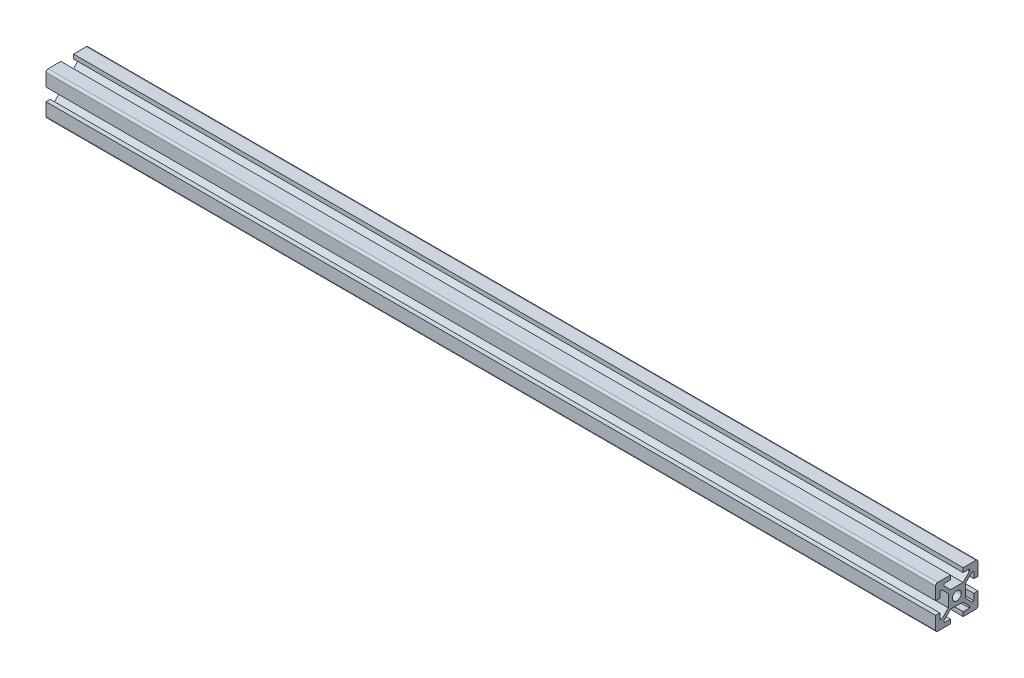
ISO-10303-21;
HEADER;
FILE_DESCRIPTION(('STEP AP214'),'2;1');
FILE_NAME('part.step','',(''),(''),'','','');
FILE_SCHEMA(('AUTOMOTIVE_DESIGN { 1 0 10303 214 1 1 1 1 }'));
ENDSEC;
DATA;
#1=APPLICATION_CONTEXT('core data for automotive mechanical design processes');
#2=APPLICATION_PROTOCOL_DEFINITION('international standard','automotive_design',2000,#1);
#3=PRODUCT_CONTEXT('',#1,'mechanical');
#4=PRODUCT('Part','Part','',(#3));
#5=PRODUCT_RELATED_PRODUCT_CATEGORY('part','',(#4));
#6=PRODUCT_DEFINITION_FORMATION('','',#4);
#7=PRODUCT_DEFINITION_CONTEXT('part definition',#1,'design');
#8=PRODUCT_DEFINITION('design','',#6,#7);
#9=PRODUCT_DEFINITION_SHAPE('','',#8);
#10=(LENGTH_UNIT() NAMED_UNIT(*) SI_UNIT(.MILLI.,.METRE.));
#11=(NAMED_UNIT(*) PLANE_ANGLE_UNIT() SI_UNIT($,.RADIAN.));
#12=(NAMED_UNIT(*) SI_UNIT($,.STERADIAN.) SOLID_ANGLE_UNIT());
#13=UNCERTAINTY_MEASURE_WITH_UNIT(LENGTH_MEASURE(1.E-05),#10,'distance_accuracy_value','');
#14=(GEOMETRIC_REPRESENTATION_CONTEXT(3) GLOBAL_UNCERTAINTY_ASSIGNED_CONTEXT((#13)) GLOBAL_UNIT_ASSIGNED_CONTEXT((#10,
#11,#12)) REPRESENTATION_CONTEXT('',''));
#15=CARTESIAN_POINT('',(0.,0.,0.));
#16=DIRECTION('',(0.,0.,1.));
#17=DIRECTION('',(1.,0.,0.));
#18=AXIS2_PLACEMENT_3D('',#15,#16,#17);
#19=CARTESIAN_POINT('',(420.,9.,9.));
#20=DIRECTION('',(1.,0.,0.));
#21=DIRECTION('',(0.,0.,-1.));
#22=AXIS2_PLACEMENT_3D('',#19,#20,#21);
#23=PLANE('',#22);
#24=CARTESIAN_POINT('',(420.,9.,9.));
#25=DIRECTION('',(1.,0.,0.));
#26=DIRECTION('',(0.,0.,-1.));
#27=AXIS2_PLACEMENT_3D('',#24,#25,#26);
#28=CIRCLE('',#27,1.);
#29=CARTESIAN_POINT('',(420.,10.,9.));
#30=VERTEX_POINT('',#29);
#31=CARTESIAN_POINT('',(420.,9.,10.));
#32=VERTEX_POINT('',#31);
#33=EDGE_CURVE('E467',#30,#32,#28,.T.);
#34=ORIENTED_EDGE('',*,*,#33,.T.);
#35=DIRECTION('',(0.,-1.,0.));
#36=VECTOR('',#35,1.);
#37=CARTESIAN_POINT('',(420.,9.,10.));
#38=LINE('',#37,#36);
#39=CARTESIAN_POINT('',(420.,3.,10.));
#40=VERTEX_POINT('',#39);
#41=EDGE_CURVE('E215',#32,#40,#38,.T.);
#42=ORIENTED_EDGE('',*,*,#41,.T.);
#43=DIRECTION('',(0.,0.,-1.));
#44=VECTOR('',#43,1.);
#45=CARTESIAN_POINT('',(420.,3.,10.));
#46=LINE('',#45,#44);
#47=CARTESIAN_POINT('',(420.,3.,8.));
#48=VERTEX_POINT('',#47);
#49=EDGE_CURVE('E602',#40,#48,#46,.T.);
#50=ORIENTED_EDGE('',*,*,#49,.T.);
#51=DIRECTION('',(0.,1.,0.));
#52=VECTOR('',#51,1.);
#53=CARTESIAN_POINT('',(420.,3.,8.));
#54=LINE('',#53,#52);
#55=CARTESIAN_POINT('',(420.,6.,8.));
#56=VERTEX_POINT('',#55);
#57=EDGE_CURVE('E621',#48,#56,#54,.T.);
#58=ORIENTED_EDGE('',*,*,#57,.T.);
#59=DIRECTION('',(0.,0.,-1.));
#60=VECTOR('',#59,1.);
#61=CARTESIAN_POINT('',(420.,6.,8.));
#62=LINE('',#61,#60);
#63=CARTESIAN_POINT('',(420.,6.,7.06066017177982));
#64=VERTEX_POINT('',#63);
#65=EDGE_CURVE('E618',#56,#64,#62,.T.);
#66=ORIENTED_EDGE('',*,*,#65,.T.);
#67=DIRECTION('',(0.,-0.707106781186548,-0.707106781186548));
#68=VECTOR('',#67,1.);
#69=CARTESIAN_POINT('',(420.,6.,7.06066017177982));
#70=LINE('',#69,#68);
#71=CARTESIAN_POINT('',(420.,2.93933982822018,4.));
#72=VERTEX_POINT('',#71);
#73=EDGE_CURVE('E620',#64,#72,#70,.T.);
#74=ORIENTED_EDGE('',*,*,#73,.T.);
#75=DIRECTION('',(0.,-1.,0.));
#76=VECTOR('',#75,1.);
#77=CARTESIAN_POINT('',(420.,2.93933982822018,4.));
#78=LINE('',#77,#76);
#79=CARTESIAN_POINT('',(420.,-2.93933982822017,4.));
#80=VERTEX_POINT('',#79);
#81=EDGE_CURVE('E623',#72,#80,#78,.T.);
#82=ORIENTED_EDGE('',*,*,#81,.T.);
#83=DIRECTION('',(0.,-0.707106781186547,0.707106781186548));
#84=VECTOR('',#83,1.);
#85=CARTESIAN_POINT('',(420.,-2.93933982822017,4.));
#86=LINE('',#85,#84);
#87=CARTESIAN_POINT('',(420.,-6.,7.06066017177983));
#88=VERTEX_POINT('',#87);
#89=EDGE_CURVE('E629',#80,#88,#86,.T.);
#90=ORIENTED_EDGE('',*,*,#89,.T.);
#91=DIRECTION('',(0.,0.,1.));
#92=VECTOR('',#91,1.);
#93=CARTESIAN_POINT('',(420.,-6.,7.06066017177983));
#94=LINE('',#93,#92);
#95=CARTESIAN_POINT('',(420.,-6.,7.99999999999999));
#96=VERTEX_POINT('',#95);
#97=EDGE_CURVE('E631',#88,#96,#94,.T.);
#98=ORIENTED_EDGE('',*,*,#97,.T.);
#99=DIRECTION('',(0.,1.,0.));
#100=VECTOR('',#99,1.);
#101=CARTESIAN_POINT('',(420.,-6.,7.99999999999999));
#102=LINE('',#101,#100);
#103=CARTESIAN_POINT('',(420.,-3.,7.99999999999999));
#104=VERTEX_POINT('',#103);
#105=EDGE_CURVE('E633',#96,#104,#102,.T.);
#106=ORIENTED_EDGE('',*,*,#105,.T.);
#107=DIRECTION('',(0.,0.,1.));
#108=VECTOR('',#107,1.);
#109=CARTESIAN_POINT('',(420.,-3.,7.99999999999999));
#110=LINE('',#109,#108);
#111=CARTESIAN_POINT('',(420.,-3.,10.));
#112=VERTEX_POINT('',#111);
#113=EDGE_CURVE('E635',#104,#112,#110,.T.);
#114=ORIENTED_EDGE('',*,*,#113,.T.);
#115=DIRECTION('',(0.,-1.,0.));
#116=VECTOR('',#115,1.);
#117=CARTESIAN_POINT('',(420.,-3.,10.));
#118=LINE('',#117,#116);
#119=CARTESIAN_POINT('',(420.,-9.,10.));
#120=VERTEX_POINT('',#119);
#121=EDGE_CURVE('E637',#112,#120,#118,.T.);
#122=ORIENTED_EDGE('',*,*,#121,.T.);
#123=CARTESIAN_POINT('',(420.,-9.,9.));
#124=DIRECTION('',(1.,0.,0.));
#125=DIRECTION('',(0.,0.,-1.));
#126=AXIS2_PLACEMENT_3D('',#123,#124,#125);
#127=CIRCLE('',#126,1.);
#128=CARTESIAN_POINT('',(420.,-10.,9.));
#129=VERTEX_POINT('',#128);
#130=EDGE_CURVE('E639',#120,#129,#127,.T.);
#131=ORIENTED_EDGE('',*,*,#130,.T.);
#132=DIRECTION('',(0.,0.,-1.));
#133=VECTOR('',#132,1.);
#134=CARTESIAN_POINT('',(420.,-10.,9.));
#135=LINE('',#134,#133);
#136=CARTESIAN_POINT('',(420.,-10.,3.));
#137=VERTEX_POINT('',#136);
#138=EDGE_CURVE('E641',#129,#137,#135,.T.);
#139=ORIENTED_EDGE('',*,*,#138,.T.);
#140=DIRECTION('',(0.,1.,0.));
#141=VECTOR('',#140,1.);
#142=CARTESIAN_POINT('',(420.,-10.,3.));
#143=LINE('',#142,#141);
#144=CARTESIAN_POINT('',(420.,-8.,3.));
#145=VERTEX_POINT('',#144);
#146=EDGE_CURVE('E643',#137,#145,#143,.T.);
#147=ORIENTED_EDGE('',*,*,#146,.T.);
#148=DIRECTION('',(0.,0.,1.));
#149=VECTOR('',#148,1.);
#150=CARTESIAN_POINT('',(420.,-8.,3.));
#151=LINE('',#150,#149);
#152=CARTESIAN_POINT('',(420.,-8.,6.));
#153=VERTEX_POINT('',#152);
#154=EDGE_CURVE('E645',#145,#153,#151,.T.);
#155=ORIENTED_EDGE('',*,*,#154,.T.);
#156=DIRECTION('',(0.,1.,0.));
#157=VECTOR('',#156,1.);
#158=CARTESIAN_POINT('',(420.,-8.,6.));
#159=LINE('',#158,#157);
#160=CARTESIAN_POINT('',(420.,-7.06066017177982,6.));
#161=VERTEX_POINT('',#160);
#162=EDGE_CURVE('E647',#153,#161,#159,.T.);
#163=ORIENTED_EDGE('',*,*,#162,.T.);
#164=DIRECTION('',(0.,0.707106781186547,-0.707106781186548));
#165=VECTOR('',#164,1.);
#166=CARTESIAN_POINT('',(420.,-7.06066017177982,6.));
#167=LINE('',#166,#165);
#168=CARTESIAN_POINT('',(420.,-4.,2.93933982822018));
#169=VERTEX_POINT('',#168);
#170=EDGE_CURVE('E649',#161,#169,#167,.T.);
#171=ORIENTED_EDGE('',*,*,#170,.T.);
#172=DIRECTION('',(0.,0.,-1.));
#173=VECTOR('',#172,1.);
#174=CARTESIAN_POINT('',(420.,-4.,2.93933982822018));
#175=LINE('',#174,#173);
#176=CARTESIAN_POINT('',(420.,-4.,-2.93933982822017));
#177=VERTEX_POINT('',#176);
#178=EDGE_CURVE('E651',#169,#177,#175,.T.);
#179=ORIENTED_EDGE('',*,*,#178,.T.);
#180=DIRECTION('',(0.,-0.707106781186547,-0.707106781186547));
#181=VECTOR('',#180,1.);
#182=CARTESIAN_POINT('',(420.,-4.,-2.93933982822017));
#183=LINE('',#182,#181);
#184=CARTESIAN_POINT('',(420.,-7.06066017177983,-6.));
#185=VERTEX_POINT('',#184);
#186=EDGE_CURVE('E653',#177,#185,#183,.T.);
#187=ORIENTED_EDGE('',*,*,#186,.T.);
#188=DIRECTION('',(0.,-1.,0.));
#189=VECTOR('',#188,1.);
#190=CARTESIAN_POINT('',(420.,-7.06066017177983,-6.));
#191=LINE('',#190,#189);
#192=CARTESIAN_POINT('',(420.,-7.99999999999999,-6.));
#193=VERTEX_POINT('',#192);
#194=EDGE_CURVE('E655',#185,#193,#191,.T.);
#195=ORIENTED_EDGE('',*,*,#194,.T.);
#196=DIRECTION('',(0.,0.,1.));
#197=VECTOR('',#196,1.);
#198=CARTESIAN_POINT('',(420.,-7.99999999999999,-6.));
#199=LINE('',#198,#197);
#200=CARTESIAN_POINT('',(420.,-7.99999999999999,-3.));
#201=VERTEX_POINT('',#200);
#202=EDGE_CURVE('E657',#193,#201,#199,.T.);
#203=ORIENTED_EDGE('',*,*,#202,.T.);
#204=DIRECTION('',(0.,-1.,0.));
#205=VECTOR('',#204,1.);
#206=CARTESIAN_POINT('',(420.,-7.99999999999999,-3.));
#207=LINE('',#206,#205);
#208=CARTESIAN_POINT('',(420.,-10.,-3.));
#209=VERTEX_POINT('',#208);
#210=EDGE_CURVE('E659',#201,#209,#207,.T.);
#211=ORIENTED_EDGE('',*,*,#210,.T.);
#212=DIRECTION('',(0.,0.,-1.));
#213=VECTOR('',#212,1.);
#214=CARTESIAN_POINT('',(420.,-10.,-3.));
#215=LINE('',#214,#213);
#216=CARTESIAN_POINT('',(420.,-10.,-9.00000000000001));
#217=VERTEX_POINT('',#216);
#218=EDGE_CURVE('E661',#209,#217,#215,.T.);
#219=ORIENTED_EDGE('',*,*,#218,.T.);
#220=CARTESIAN_POINT('',(420.,-9.,-9.00000000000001));
#221=DIRECTION('',(1.,0.,0.));
#222=DIRECTION('',(0.,0.,-1.));
#223=AXIS2_PLACEMENT_3D('',#220,#221,#222);
#224=CIRCLE('',#223,0.999999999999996);
#225=CARTESIAN_POINT('',(420.,-9.,-10.));
#226=VERTEX_POINT('',#225);
#227=EDGE_CURVE('E663',#217,#226,#224,.T.);
#228=ORIENTED_EDGE('',*,*,#227,.T.);
#229=DIRECTION('',(0.,1.,0.));
#230=VECTOR('',#229,1.);
#231=CARTESIAN_POINT('',(420.,-9.,-10.));
#232=LINE('',#231,#230);
#233=CARTESIAN_POINT('',(420.,-3.,-10.));
#234=VERTEX_POINT('',#233);
#235=EDGE_CURVE('E665',#226,#234,#232,.T.);
#236=ORIENTED_EDGE('',*,*,#235,.T.);
#237=DIRECTION('',(0.,0.,1.));
#238=VECTOR('',#237,1.);
#239=CARTESIAN_POINT('',(420.,-3.,-10.));
#240=LINE('',#239,#238);
#241=CARTESIAN_POINT('',(420.,-3.,-8.00000000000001));
#242=VERTEX_POINT('',#241);
#243=EDGE_CURVE('E667',#234,#242,#240,.T.);
#244=ORIENTED_EDGE('',*,*,#243,.T.);
#245=DIRECTION('',(0.,-1.,0.));
#246=VECTOR('',#245,1.);
#247=CARTESIAN_POINT('',(420.,-3.,-8.00000000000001));
#248=LINE('',#247,#246);
#249=CARTESIAN_POINT('',(420.,-6.,-8.00000000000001));
#250=VERTEX_POINT('',#249);
#251=EDGE_CURVE('E669',#242,#250,#248,.T.);
#252=ORIENTED_EDGE('',*,*,#251,.T.);
#253=DIRECTION('',(0.,0.,1.));
#254=VECTOR('',#253,1.);
#255=CARTESIAN_POINT('',(420.,-6.,-8.00000000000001));
#256=LINE('',#255,#254);
#257=CARTESIAN_POINT('',(420.,-6.,-7.06066017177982));
#258=VERTEX_POINT('',#257);
#259=EDGE_CURVE('E671',#250,#258,#256,.T.);
#260=ORIENTED_EDGE('',*,*,#259,.T.);
#261=DIRECTION('',(0.,0.707106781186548,0.707106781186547));
#262=VECTOR('',#261,1.);
#263=CARTESIAN_POINT('',(420.,-6.,-7.06066017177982));
#264=LINE('',#263,#262);
#265=CARTESIAN_POINT('',(420.,-2.93933982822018,-4.));
#266=VERTEX_POINT('',#265);
#267=EDGE_CURVE('E673',#258,#266,#264,.T.);
#268=ORIENTED_EDGE('',*,*,#267,.T.);
#269=DIRECTION('',(0.,1.,0.));
#270=VECTOR('',#269,1.);
#271=CARTESIAN_POINT('',(420.,-2.93933982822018,-4.));
#272=LINE('',#271,#270);
#273=CARTESIAN_POINT('',(420.,2.93933982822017,-4.));
#274=VERTEX_POINT('',#273);
#275=EDGE_CURVE('E675',#266,#274,#272,.T.);
#276=ORIENTED_EDGE('',*,*,#275,.T.);
#277=DIRECTION('',(0.,0.707106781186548,-0.707106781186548));
#278=VECTOR('',#277,1.);
#279=CARTESIAN_POINT('',(420.,2.93933982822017,-4.));
#280=LINE('',#279,#278);
#281=CARTESIAN_POINT('',(420.,6.,-7.06066017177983));
#282=VERTEX_POINT('',#281);
#283=EDGE_CURVE('E677',#274,#282,#280,.T.);
#284=ORIENTED_EDGE('',*,*,#283,.T.);
#285=DIRECTION('',(0.,0.,-1.));
#286=VECTOR('',#285,1.);
#287=CARTESIAN_POINT('',(420.,6.,-7.06066017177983));
#288=LINE('',#287,#286);
#289=CARTESIAN_POINT('',(420.,6.,-7.99999999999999));
#290=VERTEX_POINT('',#289);
#291=EDGE_CURVE('E679',#282,#290,#288,.T.);
#292=ORIENTED_EDGE('',*,*,#291,.T.);
#293=DIRECTION('',(0.,-1.,0.));
#294=VECTOR('',#293,1.);
#295=CARTESIAN_POINT('',(420.,6.,-7.99999999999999));
#296=LINE('',#295,#294);
#297=CARTESIAN_POINT('',(420.,3.,-7.99999999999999));
#298=VERTEX_POINT('',#297);
#299=EDGE_CURVE('E681',#290,#298,#296,.T.);
#300=ORIENTED_EDGE('',*,*,#299,.T.);
#301=DIRECTION('',(0.,0.,-1.));
#302=VECTOR('',#301,1.);
#303=CARTESIAN_POINT('',(420.,3.,-7.99999999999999));
#304=LINE('',#303,#302);
#305=CARTESIAN_POINT('',(420.,3.,-10.));
#306=VERTEX_POINT('',#305);
#307=EDGE_CURVE('E683',#298,#306,#304,.T.);
#308=ORIENTED_EDGE('',*,*,#307,.T.);
#309=DIRECTION('',(0.,1.,0.));
#310=VECTOR('',#309,1.);
#311=CARTESIAN_POINT('',(420.,3.,-10.));
#312=LINE('',#311,#310);
#313=CARTESIAN_POINT('',(420.,9.,-10.));
#314=VERTEX_POINT('',#313);
#315=EDGE_CURVE('E685',#306,#314,#312,.T.);
#316=ORIENTED_EDGE('',*,*,#315,.T.);
#317=CARTESIAN_POINT('',(420.,9.,-9.00000000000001));
#318=DIRECTION('',(1.,0.,0.));
#319=DIRECTION('',(0.,0.,-1.));
#320=AXIS2_PLACEMENT_3D('',#317,#318,#319);
#321=CIRCLE('',#320,1.);
#322=CARTESIAN_POINT('',(420.,10.,-9.00000000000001));
#323=VERTEX_POINT('',#322);
#324=EDGE_CURVE('E687',#314,#323,#321,.T.);
#325=ORIENTED_EDGE('',*,*,#324,.T.);
#326=DIRECTION('',(0.,0.,1.));
#327=VECTOR('',#326,1.);
#328=CARTESIAN_POINT('',(420.,10.,-9.00000000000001));
#329=LINE('',#328,#327);
#330=CARTESIAN_POINT('',(420.,10.,-3.));
#331=VERTEX_POINT('',#330);
#332=EDGE_CURVE('E689',#323,#331,#329,.T.);
#333=ORIENTED_EDGE('',*,*,#332,.T.);
#334=DIRECTION('',(0.,-1.,0.));
#335=VECTOR('',#334,1.);
#336=CARTESIAN_POINT('',(420.,10.,-3.));
#337=LINE('',#336,#335);
#338=CARTESIAN_POINT('',(420.,8.,-3.));
#339=VERTEX_POINT('',#338);
#340=EDGE_CURVE('E691',#331,#339,#337,.T.);
#341=ORIENTED_EDGE('',*,*,#340,.T.);
#342=DIRECTION('',(0.,0.,-1.));
#343=VECTOR('',#342,1.);
#344=CARTESIAN_POINT('',(420.,8.,-3.));
#345=LINE('',#344,#343);
#346=CARTESIAN_POINT('',(420.,8.,-6.));
#347=VERTEX_POINT('',#346);
#348=EDGE_CURVE('E693',#339,#347,#345,.T.);
#349=ORIENTED_EDGE('',*,*,#348,.T.);
#350=DIRECTION('',(0.,-1.,0.));
#351=VECTOR('',#350,1.);
#352=CARTESIAN_POINT('',(420.,8.,-6.));
#353=LINE('',#352,#351);
#354=CARTESIAN_POINT('',(420.,7.06066017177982,-6.));
#355=VERTEX_POINT('',#354);
#356=EDGE_CURVE('E695',#347,#355,#353,.T.);
#357=ORIENTED_EDGE('',*,*,#356,.T.);
#358=DIRECTION('',(0.,-0.707106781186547,0.707106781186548));
#359=VECTOR('',#358,1.);
#360=CARTESIAN_POINT('',(420.,7.06066017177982,-6.));
#361=LINE('',#360,#359);
#362=CARTESIAN_POINT('',(420.,4.,-2.93933982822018));
#363=VERTEX_POINT('',#362);
#364=EDGE_CURVE('E697',#355,#363,#361,.T.);
#365=ORIENTED_EDGE('',*,*,#364,.T.);
#366=DIRECTION('',(0.,0.,1.));
#367=VECTOR('',#366,1.);
#368=CARTESIAN_POINT('',(420.,4.,-2.93933982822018));
#369=LINE('',#368,#367);
#370=CARTESIAN_POINT('',(420.,4.,2.93933982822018));
#371=VERTEX_POINT('',#370);
#372=EDGE_CURVE('E699',#363,#371,#369,.T.);
#373=ORIENTED_EDGE('',*,*,#372,.T.);
#374=DIRECTION('',(0.,0.707106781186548,0.707106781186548));
#375=VECTOR('',#374,1.);
#376=CARTESIAN_POINT('',(420.,4.,2.93933982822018));
#377=LINE('',#376,#375);
#378=CARTESIAN_POINT('',(420.,7.06066017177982,6.));
#379=VERTEX_POINT('',#378);
#380=EDGE_CURVE('E701',#371,#379,#377,.T.);
#381=ORIENTED_EDGE('',*,*,#380,.T.);
#382=DIRECTION('',(0.,1.,0.));
#383=VECTOR('',#382,1.);
#384=CARTESIAN_POINT('',(420.,7.06066017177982,6.));
#385=LINE('',#384,#383);
#386=CARTESIAN_POINT('',(420.,7.99999999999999,6.));
#387=VERTEX_POINT('',#386);
#388=EDGE_CURVE('E354',#379,#387,#385,.T.);
#389=ORIENTED_EDGE('',*,*,#388,.T.);
#390=DIRECTION('',(0.,0.,-1.));
#391=VECTOR('',#390,1.);
#392=CARTESIAN_POINT('',(420.,7.99999999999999,6.));
#393=LINE('',#392,#391);
#394=CARTESIAN_POINT('',(420.,7.99999999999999,3.));
#395=VERTEX_POINT('',#394);
#396=EDGE_CURVE('E348',#387,#395,#393,.T.);
#397=ORIENTED_EDGE('',*,*,#396,.T.);
#398=DIRECTION('',(0.,1.,0.));
#399=VECTOR('',#398,1.);
#400=CARTESIAN_POINT('',(420.,7.99999999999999,3.));
#401=LINE('',#400,#399);
#402=CARTESIAN_POINT('',(420.,10.,3.));
#403=VERTEX_POINT('',#402);
#404=EDGE_CURVE('E352',#395,#403,#401,.T.);
#405=ORIENTED_EDGE('',*,*,#404,.T.);
#406=DIRECTION('',(0.,0.,1.));
#407=VECTOR('',#406,1.);
#408=CARTESIAN_POINT('',(420.,10.,3.));
#409=LINE('',#408,#407);
#410=EDGE_CURVE('E52',#403,#30,#409,.T.);
#411=ORIENTED_EDGE('',*,*,#410,.T.);
#412=EDGE_LOOP('',(#34,#42,#50,#58,#66,#74,#82,#90,#98,#106,#114,#122,#131,#139,#147,#155,#163,
#171,#179,#187,#195,#203,#211,#219,#228,#236,#244,#252,#260,#268,#276,#284,#292,#300,#308,#316,
#325,#333,#341,#349,#357,#365,#373,#381,#389,#397,#405,#411));
#413=FACE_BOUND('',#412,.T.);
#414=CARTESIAN_POINT('',(420.,0.,0.));
#415=DIRECTION('',(1.,0.,0.));
#416=DIRECTION('',(0.,0.,-1.));
#417=AXIS2_PLACEMENT_3D('',#414,#415,#416);
#418=CIRCLE('',#417,2.1);
#419=CARTESIAN_POINT('',(420.,0.,-2.1));
#420=VERTEX_POINT('',#419);
#421=EDGE_CURVE('E376',#420,#420,#418,.T.);
#422=ORIENTED_EDGE('',*,*,#421,.F.);
#423=EDGE_LOOP('',(#422));
#424=FACE_BOUND('',#423,.T.);
#425=ADVANCED_FACE('F35',(#413,#424),#23,.T.);
#426=CARTESIAN_POINT('',(0.,9.,9.));
#427=DIRECTION('',(1.,0.,0.));
#428=DIRECTION('',(0.,0.,-1.));
#429=AXIS2_PLACEMENT_3D('',#426,#427,#428);
#430=PLANE('',#429);
#431=CARTESIAN_POINT('',(0.,9.,9.));
#432=DIRECTION('',(1.,0.,0.));
#433=DIRECTION('',(0.,0.,-1.));
#434=AXIS2_PLACEMENT_3D('',#431,#432,#433);
#435=CIRCLE('',#434,1.);
#436=CARTESIAN_POINT('',(0.,10.,9.));
#437=VERTEX_POINT('',#436);
#438=CARTESIAN_POINT('',(0.,9.,10.));
#439=VERTEX_POINT('',#438);
#440=EDGE_CURVE('E372',#437,#439,#435,.T.);
#441=ORIENTED_EDGE('',*,*,#440,.F.);
#442=DIRECTION('',(0.,0.,1.));
#443=VECTOR('',#442,1.);
#444=CARTESIAN_POINT('',(0.,10.,3.));
#445=LINE('',#444,#443);
#446=CARTESIAN_POINT('',(0.,10.,3.));
#447=VERTEX_POINT('',#446);
#448=EDGE_CURVE('E207',#447,#437,#445,.T.);
#449=ORIENTED_EDGE('',*,*,#448,.F.);
#450=DIRECTION('',(0.,1.,0.));
#451=VECTOR('',#450,1.);
#452=CARTESIAN_POINT('',(0.,7.99999999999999,3.));
#453=LINE('',#452,#451);
#454=CARTESIAN_POINT('',(0.,7.99999999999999,3.));
#455=VERTEX_POINT('',#454);
#456=EDGE_CURVE('E201',#455,#447,#453,.T.);
#457=ORIENTED_EDGE('',*,*,#456,.F.);
#458=DIRECTION('',(0.,0.,-1.));
#459=VECTOR('',#458,1.);
#460=CARTESIAN_POINT('',(0.,7.99999999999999,6.));
#461=LINE('',#460,#459);
#462=CARTESIAN_POINT('',(0.,7.99999999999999,6.));
#463=VERTEX_POINT('',#462);
#464=EDGE_CURVE('E362',#463,#455,#461,.T.);
#465=ORIENTED_EDGE('',*,*,#464,.F.);
#466=DIRECTION('',(0.,1.,0.));
#467=VECTOR('',#466,1.);
#468=CARTESIAN_POINT('',(0.,7.06066017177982,6.));
#469=LINE('',#468,#467);
#470=CARTESIAN_POINT('',(0.,7.06066017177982,6.));
#471=VERTEX_POINT('',#470);
#472=EDGE_CURVE('E462',#471,#463,#469,.T.);
#473=ORIENTED_EDGE('',*,*,#472,.F.);
#474=DIRECTION('',(0.,0.707106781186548,0.707106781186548));
#475=VECTOR('',#474,1.);
#476=CARTESIAN_POINT('',(0.,4.,2.93933982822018));
#477=LINE('',#476,#475);
#478=CARTESIAN_POINT('',(0.,4.,2.93933982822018));
#479=VERTEX_POINT('',#478);
#480=EDGE_CURVE('E460',#479,#471,#477,.T.);
#481=ORIENTED_EDGE('',*,*,#480,.F.);
#482=DIRECTION('',(0.,0.,1.));
#483=VECTOR('',#482,1.);
#484=CARTESIAN_POINT('',(0.,4.,-2.93933982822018));
#485=LINE('',#484,#483);
#486=CARTESIAN_POINT('',(0.,4.,-2.93933982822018));
#487=VERTEX_POINT('',#486);
#488=EDGE_CURVE('E458',#487,#479,#485,.T.);
#489=ORIENTED_EDGE('',*,*,#488,.F.);
#490=DIRECTION('',(0.,-0.707106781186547,0.707106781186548));
#491=VECTOR('',#490,1.);
#492=CARTESIAN_POINT('',(0.,7.06066017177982,-6.));
#493=LINE('',#492,#491);
#494=CARTESIAN_POINT('',(0.,7.06066017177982,-6.));
#495=VERTEX_POINT('',#494);
#496=EDGE_CURVE('E456',#495,#487,#493,.T.);
#497=ORIENTED_EDGE('',*,*,#496,.F.);
#498=DIRECTION('',(0.,-1.,0.));
#499=VECTOR('',#498,1.);
#500=CARTESIAN_POINT('',(0.,8.,-6.));
#501=LINE('',#500,#499);
#502=CARTESIAN_POINT('',(0.,8.,-6.));
#503=VERTEX_POINT('',#502);
#504=EDGE_CURVE('E454',#503,#495,#501,.T.);
#505=ORIENTED_EDGE('',*,*,#504,.F.);
#506=DIRECTION('',(0.,0.,-1.));
#507=VECTOR('',#506,1.);
#508=CARTESIAN_POINT('',(0.,8.,-3.));
#509=LINE('',#508,#507);
#510=CARTESIAN_POINT('',(0.,8.,-3.));
#511=VERTEX_POINT('',#510);
#512=EDGE_CURVE('E452',#511,#503,#509,.T.);
#513=ORIENTED_EDGE('',*,*,#512,.F.);
#514=DIRECTION('',(0.,-1.,0.));
#515=VECTOR('',#514,1.);
#516=CARTESIAN_POINT('',(0.,10.,-3.));
#517=LINE('',#516,#515);
#518=CARTESIAN_POINT('',(0.,10.,-3.));
#519=VERTEX_POINT('',#518);
#520=EDGE_CURVE('E450',#519,#511,#517,.T.);
#521=ORIENTED_EDGE('',*,*,#520,.F.);
#522=DIRECTION('',(0.,0.,1.));
#523=VECTOR('',#522,1.);
#524=CARTESIAN_POINT('',(0.,10.,-9.00000000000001));
#525=LINE('',#524,#523);
#526=CARTESIAN_POINT('',(0.,10.,-9.00000000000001));
#527=VERTEX_POINT('',#526);
#528=EDGE_CURVE('E448',#527,#519,#525,.T.);
#529=ORIENTED_EDGE('',*,*,#528,.F.);
#530=CARTESIAN_POINT('',(0.,9.,-9.00000000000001));
#531=DIRECTION('',(1.,0.,0.));
#532=DIRECTION('',(0.,0.,-1.));
#533=AXIS2_PLACEMENT_3D('',#530,#531,#532);
#534=CIRCLE('',#533,1.);
#535=CARTESIAN_POINT('',(0.,9.,-10.));
#536=VERTEX_POINT('',#535);
#537=EDGE_CURVE('E446',#536,#527,#534,.T.);
#538=ORIENTED_EDGE('',*,*,#537,.F.);
#539=DIRECTION('',(0.,1.,0.));
#540=VECTOR('',#539,1.);
#541=CARTESIAN_POINT('',(0.,3.,-10.));
#542=LINE('',#541,#540);
#543=CARTESIAN_POINT('',(0.,3.,-10.));
#544=VERTEX_POINT('',#543);
#545=EDGE_CURVE('E444',#544,#536,#542,.T.);
#546=ORIENTED_EDGE('',*,*,#545,.F.);
#547=DIRECTION('',(0.,0.,-1.));
#548=VECTOR('',#547,1.);
#549=CARTESIAN_POINT('',(0.,3.,-7.99999999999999));
#550=LINE('',#549,#548);
#551=CARTESIAN_POINT('',(0.,3.,-7.99999999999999));
#552=VERTEX_POINT('',#551);
#553=EDGE_CURVE('E442',#552,#544,#550,.T.);
#554=ORIENTED_EDGE('',*,*,#553,.F.);
#555=DIRECTION('',(0.,-1.,0.));
#556=VECTOR('',#555,1.);
#557=CARTESIAN_POINT('',(0.,6.,-7.99999999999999));
#558=LINE('',#557,#556);
#559=CARTESIAN_POINT('',(0.,6.,-7.99999999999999));
#560=VERTEX_POINT('',#559);
#561=EDGE_CURVE('E440',#560,#552,#558,.T.);
#562=ORIENTED_EDGE('',*,*,#561,.F.);
#563=DIRECTION('',(0.,0.,-1.));
#564=VECTOR('',#563,1.);
#565=CARTESIAN_POINT('',(0.,6.,-7.06066017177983));
#566=LINE('',#565,#564);
#567=CARTESIAN_POINT('',(0.,6.,-7.06066017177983));
#568=VERTEX_POINT('',#567);
#569=EDGE_CURVE('E438',#568,#560,#566,.T.);
#570=ORIENTED_EDGE('',*,*,#569,.F.);
#571=DIRECTION('',(0.,0.707106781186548,-0.707106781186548));
#572=VECTOR('',#571,1.);
#573=CARTESIAN_POINT('',(0.,2.93933982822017,-4.));
#574=LINE('',#573,#572);
#575=CARTESIAN_POINT('',(0.,2.93933982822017,-4.));
#576=VERTEX_POINT('',#575);
#577=EDGE_CURVE('E436',#576,#568,#574,.T.);
#578=ORIENTED_EDGE('',*,*,#577,.F.);
#579=DIRECTION('',(0.,1.,0.));
#580=VECTOR('',#579,1.);
#581=CARTESIAN_POINT('',(0.,-2.93933982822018,-4.));
#582=LINE('',#581,#580);
#583=CARTESIAN_POINT('',(0.,-2.93933982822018,-4.));
#584=VERTEX_POINT('',#583);
#585=EDGE_CURVE('E434',#584,#576,#582,.T.);
#586=ORIENTED_EDGE('',*,*,#585,.F.);
#587=DIRECTION('',(0.,0.707106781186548,0.707106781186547));
#588=VECTOR('',#587,1.);
#589=CARTESIAN_POINT('',(0.,-6.,-7.06066017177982));
#590=LINE('',#589,#588);
#591=CARTESIAN_POINT('',(0.,-6.,-7.06066017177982));
#592=VERTEX_POINT('',#591);
#593=EDGE_CURVE('E432',#592,#584,#590,.T.);
#594=ORIENTED_EDGE('',*,*,#593,.F.);
#595=DIRECTION('',(0.,0.,1.));
#596=VECTOR('',#595,1.);
#597=CARTESIAN_POINT('',(0.,-6.,-8.00000000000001));
#598=LINE('',#597,#596);
#599=CARTESIAN_POINT('',(0.,-6.,-8.00000000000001));
#600=VERTEX_POINT('',#599);
#601=EDGE_CURVE('E430',#600,#592,#598,.T.);
#602=ORIENTED_EDGE('',*,*,#601,.F.);
#603=DIRECTION('',(0.,-1.,0.));
#604=VECTOR('',#603,1.);
#605=CARTESIAN_POINT('',(0.,-3.,-8.00000000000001));
#606=LINE('',#605,#604);
#607=CARTESIAN_POINT('',(0.,-3.,-8.00000000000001));
#608=VERTEX_POINT('',#607);
#609=EDGE_CURVE('E428',#608,#600,#606,.T.);
#610=ORIENTED_EDGE('',*,*,#609,.F.);
#611=DIRECTION('',(0.,0.,1.));
#612=VECTOR('',#611,1.);
#613=CARTESIAN_POINT('',(0.,-3.,-10.));
#614=LINE('',#613,#612);
#615=CARTESIAN_POINT('',(0.,-3.,-10.));
#616=VERTEX_POINT('',#615);
#617=EDGE_CURVE('E426',#616,#608,#614,.T.);
#618=ORIENTED_EDGE('',*,*,#617,.F.);
#619=DIRECTION('',(0.,1.,0.));
#620=VECTOR('',#619,1.);
#621=CARTESIAN_POINT('',(0.,-9.,-10.));
#622=LINE('',#621,#620);
#623=CARTESIAN_POINT('',(0.,-9.,-10.));
#624=VERTEX_POINT('',#623);
#625=EDGE_CURVE('E424',#624,#616,#622,.T.);
#626=ORIENTED_EDGE('',*,*,#625,.F.);
#627=CARTESIAN_POINT('',(0.,-9.,-9.00000000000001));
#628=DIRECTION('',(1.,0.,0.));
#629=DIRECTION('',(0.,0.,-1.));
#630=AXIS2_PLACEMENT_3D('',#627,#628,#629);
#631=CIRCLE('',#630,0.999999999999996);
#632=CARTESIAN_POINT('',(0.,-10.,-9.00000000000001));
#633=VERTEX_POINT('',#632);
#634=EDGE_CURVE('E422',#633,#624,#631,.T.);
#635=ORIENTED_EDGE('',*,*,#634,.F.);
#636=DIRECTION('',(0.,0.,-1.));
#637=VECTOR('',#636,1.);
#638=CARTESIAN_POINT('',(0.,-10.,-3.));
#639=LINE('',#638,#637);
#640=CARTESIAN_POINT('',(0.,-10.,-3.));
#641=VERTEX_POINT('',#640);
#642=EDGE_CURVE('E420',#641,#633,#639,.T.);
#643=ORIENTED_EDGE('',*,*,#642,.F.);
#644=DIRECTION('',(0.,-1.,0.));
#645=VECTOR('',#644,1.);
#646=CARTESIAN_POINT('',(0.,-7.99999999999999,-3.));
#647=LINE('',#646,#645);
#648=CARTESIAN_POINT('',(0.,-7.99999999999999,-3.));
#649=VERTEX_POINT('',#648);
#650=EDGE_CURVE('E418',#649,#641,#647,.T.);
#651=ORIENTED_EDGE('',*,*,#650,.F.);
#652=DIRECTION('',(0.,0.,1.));
#653=VECTOR('',#652,1.);
#654=CARTESIAN_POINT('',(0.,-7.99999999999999,-6.));
#655=LINE('',#654,#653);
#656=CARTESIAN_POINT('',(0.,-7.99999999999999,-6.));
#657=VERTEX_POINT('',#656);
#658=EDGE_CURVE('E416',#657,#649,#655,.T.);
#659=ORIENTED_EDGE('',*,*,#658,.F.);
#660=DIRECTION('',(0.,-1.,0.));
#661=VECTOR('',#660,1.);
#662=CARTESIAN_POINT('',(0.,-7.06066017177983,-6.));
#663=LINE('',#662,#661);
#664=CARTESIAN_POINT('',(0.,-7.06066017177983,-6.));
#665=VERTEX_POINT('',#664);
#666=EDGE_CURVE('E414',#665,#657,#663,.T.);
#667=ORIENTED_EDGE('',*,*,#666,.F.);
#668=DIRECTION('',(0.,-0.707106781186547,-0.707106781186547));
#669=VECTOR('',#668,1.);
#670=CARTESIAN_POINT('',(0.,-4.,-2.93933982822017));
#671=LINE('',#670,#669);
#672=CARTESIAN_POINT('',(0.,-4.,-2.93933982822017));
#673=VERTEX_POINT('',#672);
#674=EDGE_CURVE('E412',#673,#665,#671,.T.);
#675=ORIENTED_EDGE('',*,*,#674,.F.);
#676=DIRECTION('',(0.,0.,-1.));
#677=VECTOR('',#676,1.);
#678=CARTESIAN_POINT('',(0.,-4.,2.93933982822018));
#679=LINE('',#678,#677);
#680=CARTESIAN_POINT('',(0.,-4.,2.93933982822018));
#681=VERTEX_POINT('',#680);
#682=EDGE_CURVE('E410',#681,#673,#679,.T.);
#683=ORIENTED_EDGE('',*,*,#682,.F.);
#684=DIRECTION('',(0.,0.707106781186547,-0.707106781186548));
#685=VECTOR('',#684,1.);
#686=CARTESIAN_POINT('',(0.,-7.06066017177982,6.));
#687=LINE('',#686,#685);
#688=CARTESIAN_POINT('',(0.,-7.06066017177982,6.));
#689=VERTEX_POINT('',#688);
#690=EDGE_CURVE('E408',#689,#681,#687,.T.);
#691=ORIENTED_EDGE('',*,*,#690,.F.);
#692=DIRECTION('',(0.,1.,0.));
#693=VECTOR('',#692,1.);
#694=CARTESIAN_POINT('',(0.,-8.,6.));
#695=LINE('',#694,#693);
#696=CARTESIAN_POINT('',(0.,-8.,6.));
#697=VERTEX_POINT('',#696);
#698=EDGE_CURVE('E406',#697,#689,#695,.T.);
#699=ORIENTED_EDGE('',*,*,#698,.F.);
#700=DIRECTION('',(0.,0.,1.));
#701=VECTOR('',#700,1.);
#702=CARTESIAN_POINT('',(0.,-8.,3.));
#703=LINE('',#702,#701);
#704=CARTESIAN_POINT('',(0.,-8.,3.));
#705=VERTEX_POINT('',#704);
#706=EDGE_CURVE('E404',#705,#697,#703,.T.);
#707=ORIENTED_EDGE('',*,*,#706,.F.);
#708=DIRECTION('',(0.,1.,0.));
#709=VECTOR('',#708,1.);
#710=CARTESIAN_POINT('',(0.,-10.,3.));
#711=LINE('',#710,#709);
#712=CARTESIAN_POINT('',(0.,-10.,3.));
#713=VERTEX_POINT('',#712);
#714=EDGE_CURVE('E402',#713,#705,#711,.T.);
#715=ORIENTED_EDGE('',*,*,#714,.F.);
#716=DIRECTION('',(0.,0.,-1.));
#717=VECTOR('',#716,1.);
#718=CARTESIAN_POINT('',(0.,-10.,9.));
#719=LINE('',#718,#717);
#720=CARTESIAN_POINT('',(0.,-10.,9.));
#721=VERTEX_POINT('',#720);
#722=EDGE_CURVE('E400',#721,#713,#719,.T.);
#723=ORIENTED_EDGE('',*,*,#722,.F.);
#724=CARTESIAN_POINT('',(0.,-9.,9.));
#725=DIRECTION('',(1.,0.,0.));
#726=DIRECTION('',(0.,0.,-1.));
#727=AXIS2_PLACEMENT_3D('',#724,#725,#726);
#728=CIRCLE('',#727,1.);
#729=CARTESIAN_POINT('',(0.,-9.,10.));
#730=VERTEX_POINT('',#729);
#731=EDGE_CURVE('E398',#730,#721,#728,.T.);
#732=ORIENTED_EDGE('',*,*,#731,.F.);
#733=DIRECTION('',(0.,-1.,0.));
#734=VECTOR('',#733,1.);
#735=CARTESIAN_POINT('',(0.,-3.,10.));
#736=LINE('',#735,#734);
#737=CARTESIAN_POINT('',(0.,-3.,10.));
#738=VERTEX_POINT('',#737);
#739=EDGE_CURVE('E396',#738,#730,#736,.T.);
#740=ORIENTED_EDGE('',*,*,#739,.F.);
#741=DIRECTION('',(0.,0.,1.));
#742=VECTOR('',#741,1.);
#743=CARTESIAN_POINT('',(0.,-3.,7.99999999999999));
#744=LINE('',#743,#742);
#745=CARTESIAN_POINT('',(0.,-3.,7.99999999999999));
#746=VERTEX_POINT('',#745);
#747=EDGE_CURVE('E394',#746,#738,#744,.T.);
#748=ORIENTED_EDGE('',*,*,#747,.F.);
#749=DIRECTION('',(0.,1.,0.));
#750=VECTOR('',#749,1.);
#751=CARTESIAN_POINT('',(0.,-6.,7.99999999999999));
#752=LINE('',#751,#750);
#753=CARTESIAN_POINT('',(0.,-6.,7.99999999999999));
#754=VERTEX_POINT('',#753);
#755=EDGE_CURVE('E392',#754,#746,#752,.T.);
#756=ORIENTED_EDGE('',*,*,#755,.F.);
#757=DIRECTION('',(0.,0.,1.));
#758=VECTOR('',#757,1.);
#759=CARTESIAN_POINT('',(0.,-6.,7.06066017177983));
#760=LINE('',#759,#758);
#761=CARTESIAN_POINT('',(0.,-6.,7.06066017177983));
#762=VERTEX_POINT('',#761);
#763=EDGE_CURVE('E390',#762,#754,#760,.T.);
#764=ORIENTED_EDGE('',*,*,#763,.F.);
#765=DIRECTION('',(0.,-0.707106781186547,0.707106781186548));
#766=VECTOR('',#765,1.);
#767=CARTESIAN_POINT('',(0.,-2.93933982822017,4.));
#768=LINE('',#767,#766);
#769=CARTESIAN_POINT('',(0.,-2.93933982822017,4.));
#770=VERTEX_POINT('',#769);
#771=EDGE_CURVE('E388',#770,#762,#768,.T.);
#772=ORIENTED_EDGE('',*,*,#771,.F.);
#773=DIRECTION('',(0.,-1.,0.));
#774=VECTOR('',#773,1.);
#775=CARTESIAN_POINT('',(0.,2.93933982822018,4.));
#776=LINE('',#775,#774);
#777=CARTESIAN_POINT('',(0.,2.93933982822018,4.));
#778=VERTEX_POINT('',#777);
#779=EDGE_CURVE('E386',#778,#770,#776,.T.);
#780=ORIENTED_EDGE('',*,*,#779,.F.);
#781=DIRECTION('',(0.,-0.707106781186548,-0.707106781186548));
#782=VECTOR('',#781,1.);
#783=CARTESIAN_POINT('',(0.,6.,7.06066017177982));
#784=LINE('',#783,#782);
#785=CARTESIAN_POINT('',(0.,6.,7.06066017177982));
#786=VERTEX_POINT('',#785);
#787=EDGE_CURVE('E384',#786,#778,#784,.T.);
#788=ORIENTED_EDGE('',*,*,#787,.F.);
#789=DIRECTION('',(0.,0.,-1.));
#790=VECTOR('',#789,1.);
#791=CARTESIAN_POINT('',(0.,6.,8.));
#792=LINE('',#791,#790);
#793=CARTESIAN_POINT('',(0.,6.,8.));
#794=VERTEX_POINT('',#793);
#795=EDGE_CURVE('E382',#794,#786,#792,.T.);
#796=ORIENTED_EDGE('',*,*,#795,.F.);
#797=DIRECTION('',(0.,1.,0.));
#798=VECTOR('',#797,1.);
#799=CARTESIAN_POINT('',(0.,3.,8.));
#800=LINE('',#799,#798);
#801=CARTESIAN_POINT('',(0.,3.,8.));
#802=VERTEX_POINT('',#801);
#803=EDGE_CURVE('E380',#802,#794,#800,.T.);
#804=ORIENTED_EDGE('',*,*,#803,.F.);
#805=DIRECTION('',(0.,0.,-1.));
#806=VECTOR('',#805,1.);
#807=CARTESIAN_POINT('',(0.,3.,10.));
#808=LINE('',#807,#806);
#809=CARTESIAN_POINT('',(0.,3.,10.));
#810=VERTEX_POINT('',#809);
#811=EDGE_CURVE('E378',#810,#802,#808,.T.);
#812=ORIENTED_EDGE('',*,*,#811,.F.);
#813=DIRECTION('',(0.,-1.,0.));
#814=VECTOR('',#813,1.);
#815=CARTESIAN_POINT('',(0.,9.,10.));
#816=LINE('',#815,#814);
#817=EDGE_CURVE('E375',#439,#810,#816,.T.);
#818=ORIENTED_EDGE('',*,*,#817,.F.);
#819=EDGE_LOOP('',(#441,#449,#457,#465,#473,#481,#489,#497,#505,#513,#521,#529,#538,#546,#554,
#562,#570,#578,#586,#594,#602,#610,#618,#626,#635,#643,#651,#659,#667,#675,#683,#691,#699,#707,
#715,#723,#732,#740,#748,#756,#764,#772,#780,#788,#796,#804,#812,#818));
#820=FACE_BOUND('',#819,.T.);
#821=CARTESIAN_POINT('',(0.,0.,0.));
#822=DIRECTION('',(1.,0.,0.));
#823=DIRECTION('',(0.,0.,-1.));
#824=AXIS2_PLACEMENT_3D('',#821,#822,#823);
#825=CIRCLE('',#824,2.1);
#826=CARTESIAN_POINT('',(0.,0.,-2.1));
#827=VERTEX_POINT('',#826);
#828=EDGE_CURVE('E1328',#827,#827,#825,.T.);
#829=ORIENTED_EDGE('',*,*,#828,.T.);
#830=EDGE_LOOP('',(#829));
#831=FACE_BOUND('',#830,.T.);
#832=ADVANCED_FACE('F606',(#820,#831),#430,.F.);
#833=CARTESIAN_POINT('',(420.,9.,9.));
#834=DIRECTION('',(-1.,0.,0.));
#835=DIRECTION('',(0.,0.,1.));
#836=AXIS2_PLACEMENT_3D('',#833,#834,#835);
#837=CYLINDRICAL_SURFACE('',#836,1.);
#838=ORIENTED_EDGE('',*,*,#440,.T.);
#839=DIRECTION('',(-1.,0.,0.));
#840=VECTOR('',#839,1.);
#841=CARTESIAN_POINT('',(420.,9.,10.));
#842=LINE('',#841,#840);
#843=EDGE_CURVE('E11',#32,#439,#842,.T.);
#844=ORIENTED_EDGE('',*,*,#843,.F.);
#845=ORIENTED_EDGE('',*,*,#33,.F.);
#846=DIRECTION('',(-1.,0.,0.));
#847=VECTOR('',#846,1.);
#848=CARTESIAN_POINT('',(420.,10.,9.));
#849=LINE('',#848,#847);
#850=EDGE_CURVE('E368',#30,#437,#849,.T.);
#851=ORIENTED_EDGE('',*,*,#850,.T.);
#852=EDGE_LOOP('',(#838,#844,#845,#851));
#853=FACE_BOUND('',#852,.T.);
#854=ADVANCED_FACE('F37',(#853),#837,.T.);
#855=CARTESIAN_POINT('',(420.,9.,10.));
#856=DIRECTION('',(0.,0.,-1.));
#857=DIRECTION('',(-1.,0.,0.));
#858=AXIS2_PLACEMENT_3D('',#855,#856,#857);
#859=PLANE('',#858);
#860=ORIENTED_EDGE('',*,*,#817,.T.);
#861=DIRECTION('',(-1.,0.,0.));
#862=VECTOR('',#861,1.);
#863=CARTESIAN_POINT('',(420.,3.,10.));
#864=LINE('',#863,#862);
#865=EDGE_CURVE('E44',#40,#810,#864,.T.);
#866=ORIENTED_EDGE('',*,*,#865,.F.);
#867=ORIENTED_EDGE('',*,*,#41,.F.);
#868=ORIENTED_EDGE('',*,*,#843,.T.);
#869=EDGE_LOOP('',(#860,#866,#867,#868));
#870=FACE_BOUND('',#869,.T.);
#871=ADVANCED_FACE('F735',(#870),#859,.F.);
#872=CARTESIAN_POINT('',(420.,3.,10.));
#873=DIRECTION('',(0.,1.,0.));
#874=DIRECTION('',(0.,0.,1.));
#875=AXIS2_PLACEMENT_3D('',#872,#873,#874);
#876=PLANE('',#875);
#877=ORIENTED_EDGE('',*,*,#811,.T.);
#878=DIRECTION('',(-1.,0.,0.));
#879=VECTOR('',#878,1.);
#880=CARTESIAN_POINT('',(420.,3.,8.));
#881=LINE('',#880,#879);
#882=EDGE_CURVE('E594',#48,#802,#881,.T.);
#883=ORIENTED_EDGE('',*,*,#882,.F.);
#884=ORIENTED_EDGE('',*,*,#49,.F.);
#885=ORIENTED_EDGE('',*,*,#865,.T.);
#886=EDGE_LOOP('',(#877,#883,#884,#885));
#887=FACE_BOUND('',#886,.T.);
#888=ADVANCED_FACE('F600',(#887),#876,.F.);
#889=CARTESIAN_POINT('',(420.,3.,8.));
#890=DIRECTION('',(0.,0.,1.));
#891=DIRECTION('',(1.,0.,0.));
#892=AXIS2_PLACEMENT_3D('',#889,#890,#891);
#893=PLANE('',#892);
#894=ORIENTED_EDGE('',*,*,#803,.T.);
#895=DIRECTION('',(-1.,0.,0.));
#896=VECTOR('',#895,1.);
#897=CARTESIAN_POINT('',(420.,6.,8.));
#898=LINE('',#897,#896);
#899=EDGE_CURVE('E591',#56,#794,#898,.T.);
#900=ORIENTED_EDGE('',*,*,#899,.F.);
#901=ORIENTED_EDGE('',*,*,#57,.F.);
#902=ORIENTED_EDGE('',*,*,#882,.T.);
#903=EDGE_LOOP('',(#894,#900,#901,#902));
#904=FACE_BOUND('',#903,.T.);
#905=ADVANCED_FACE('F612',(#904),#893,.F.);
#906=CARTESIAN_POINT('',(420.,6.,8.));
#907=DIRECTION('',(0.,1.,0.));
#908=DIRECTION('',(0.,0.,1.));
#909=AXIS2_PLACEMENT_3D('',#906,#907,#908);
#910=PLANE('',#909);
#911=ORIENTED_EDGE('',*,*,#795,.T.);
#912=DIRECTION('',(-1.,0.,0.));
#913=VECTOR('',#912,1.);
#914=CARTESIAN_POINT('',(420.,6.,7.06066017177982));
#915=LINE('',#914,#913);
#916=EDGE_CURVE('E588',#64,#786,#915,.T.);
#917=ORIENTED_EDGE('',*,*,#916,.F.);
#918=ORIENTED_EDGE('',*,*,#65,.F.);
#919=ORIENTED_EDGE('',*,*,#899,.T.);
#920=EDGE_LOOP('',(#911,#917,#918,#919));
#921=FACE_BOUND('',#920,.T.);
#922=ADVANCED_FACE('F616',(#921),#910,.F.);
#923=CARTESIAN_POINT('',(420.,6.,7.06066017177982));
#924=DIRECTION('',(0.,0.707106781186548,-0.707106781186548));
#925=DIRECTION('',(0.,0.707106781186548,0.707106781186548));
#926=AXIS2_PLACEMENT_3D('',#923,#924,#925);
#927=PLANE('',#926);
#928=ORIENTED_EDGE('',*,*,#787,.T.);
#929=DIRECTION('',(-1.,0.,0.));
#930=VECTOR('',#929,1.);
#931=CARTESIAN_POINT('',(420.,2.93933982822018,4.));
#932=LINE('',#931,#930);
#933=EDGE_CURVE('E585',#72,#778,#932,.T.);
#934=ORIENTED_EDGE('',*,*,#933,.F.);
#935=ORIENTED_EDGE('',*,*,#73,.F.);
#936=ORIENTED_EDGE('',*,*,#916,.T.);
#937=EDGE_LOOP('',(#928,#934,#935,#936));
#938=FACE_BOUND('',#937,.T.);
#939=ADVANCED_FACE('F748',(#938),#927,.F.);
#940=CARTESIAN_POINT('',(420.,2.93933982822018,4.));
#941=DIRECTION('',(0.,0.,-1.));
#942=DIRECTION('',(-1.,0.,0.));
#943=AXIS2_PLACEMENT_3D('',#940,#941,#942);
#944=PLANE('',#943);
#945=ORIENTED_EDGE('',*,*,#779,.T.);
#946=DIRECTION('',(-1.,0.,0.));
#947=VECTOR('',#946,1.);
#948=CARTESIAN_POINT('',(420.,-2.93933982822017,4.));
#949=LINE('',#948,#947);
#950=EDGE_CURVE('E582',#80,#770,#949,.T.);
#951=ORIENTED_EDGE('',*,*,#950,.F.);
#952=ORIENTED_EDGE('',*,*,#81,.F.);
#953=ORIENTED_EDGE('',*,*,#933,.T.);
#954=EDGE_LOOP('',(#945,#951,#952,#953));
#955=FACE_BOUND('',#954,.T.);
#956=ADVANCED_FACE('F751',(#955),#944,.F.);
#957=CARTESIAN_POINT('',(420.,-2.93933982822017,4.));
#958=DIRECTION('',(0.,-0.707106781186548,-0.707106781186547));
#959=DIRECTION('',(0.,0.707106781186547,-0.707106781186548));
#960=AXIS2_PLACEMENT_3D('',#957,#958,#959);
#961=PLANE('',#960);
#962=ORIENTED_EDGE('',*,*,#771,.T.);
#963=DIRECTION('',(-1.,0.,0.));
#964=VECTOR('',#963,1.);
#965=CARTESIAN_POINT('',(420.,-6.,7.06066017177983));
#966=LINE('',#965,#964);
#967=EDGE_CURVE('E579',#88,#762,#966,.T.);
#968=ORIENTED_EDGE('',*,*,#967,.F.);
#969=ORIENTED_EDGE('',*,*,#89,.F.);
#970=ORIENTED_EDGE('',*,*,#950,.T.);
#971=EDGE_LOOP('',(#962,#968,#969,#970));
#972=FACE_BOUND('',#971,.T.);
#973=ADVANCED_FACE('F755',(#972),#961,.F.);
#974=CARTESIAN_POINT('',(420.,-6.,7.06066017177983));
#975=DIRECTION('',(0.,-1.,0.));
#976=DIRECTION('',(0.,0.,-1.));
#977=AXIS2_PLACEMENT_3D('',#974,#975,#976);
#978=PLANE('',#977);
#979=ORIENTED_EDGE('',*,*,#763,.T.);
#980=DIRECTION('',(-1.,0.,0.));
#981=VECTOR('',#980,1.);
#982=CARTESIAN_POINT('',(420.,-6.,7.99999999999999));
#983=LINE('',#982,#981);
#984=EDGE_CURVE('E576',#96,#754,#983,.T.);
#985=ORIENTED_EDGE('',*,*,#984,.F.);
#986=ORIENTED_EDGE('',*,*,#97,.F.);
#987=ORIENTED_EDGE('',*,*,#967,.T.);
#988=EDGE_LOOP('',(#979,#985,#986,#987));
#989=FACE_BOUND('',#988,.T.);
#990=ADVANCED_FACE('F759',(#989),#978,.F.);
#991=CARTESIAN_POINT('',(420.,-6.,7.99999999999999));
#992=DIRECTION('',(0.,0.,1.));
#993=DIRECTION('',(1.,0.,0.));
#994=AXIS2_PLACEMENT_3D('',#991,#992,#993);
#995=PLANE('',#994);
#996=ORIENTED_EDGE('',*,*,#755,.T.);
#997=DIRECTION('',(-1.,0.,0.));
#998=VECTOR('',#997,1.);
#999=CARTESIAN_POINT('',(420.,-3.,7.99999999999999));
#1000=LINE('',#999,#998);
#1001=EDGE_CURVE('E573',#104,#746,#1000,.T.);
#1002=ORIENTED_EDGE('',*,*,#1001,.F.);
#1003=ORIENTED_EDGE('',*,*,#105,.F.);
#1004=ORIENTED_EDGE('',*,*,#984,.T.);
#1005=EDGE_LOOP('',(#996,#1002,#1003,#1004));
#1006=FACE_BOUND('',#1005,.T.);
#1007=ADVANCED_FACE('F763',(#1006),#995,.F.);
#1008=CARTESIAN_POINT('',(420.,-3.,7.99999999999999));
#1009=DIRECTION('',(0.,-1.,0.));
#1010=DIRECTION('',(0.,0.,-1.));
#1011=AXIS2_PLACEMENT_3D('',#1008,#1009,#1010);
#1012=PLANE('',#1011);
#1013=ORIENTED_EDGE('',*,*,#747,.T.);
#1014=DIRECTION('',(-1.,0.,0.));
#1015=VECTOR('',#1014,1.);
#1016=CARTESIAN_POINT('',(420.,-3.,10.));
#1017=LINE('',#1016,#1015);
#1018=EDGE_CURVE('E570',#112,#738,#1017,.T.);
#1019=ORIENTED_EDGE('',*,*,#1018,.F.);
#1020=ORIENTED_EDGE('',*,*,#113,.F.);
#1021=ORIENTED_EDGE('',*,*,#1001,.T.);
#1022=EDGE_LOOP('',(#1013,#1019,#1020,#1021));
#1023=FACE_BOUND('',#1022,.T.);
#1024=ADVANCED_FACE('F767',(#1023),#1012,.F.);
#1025=CARTESIAN_POINT('',(420.,-3.,10.));
#1026=DIRECTION('',(0.,0.,-1.));
#1027=DIRECTION('',(-1.,0.,0.));
#1028=AXIS2_PLACEMENT_3D('',#1025,#1026,#1027);
#1029=PLANE('',#1028);
#1030=ORIENTED_EDGE('',*,*,#739,.T.);
#1031=DIRECTION('',(-1.,0.,0.));
#1032=VECTOR('',#1031,1.);
#1033=CARTESIAN_POINT('',(420.,-9.,10.));
#1034=LINE('',#1033,#1032);
#1035=EDGE_CURVE('E567',#120,#730,#1034,.T.);
#1036=ORIENTED_EDGE('',*,*,#1035,.F.);
#1037=ORIENTED_EDGE('',*,*,#121,.F.);
#1038=ORIENTED_EDGE('',*,*,#1018,.T.);
#1039=EDGE_LOOP('',(#1030,#1036,#1037,#1038));
#1040=FACE_BOUND('',#1039,.T.);
#1041=ADVANCED_FACE('F771',(#1040),#1029,.F.);
#1042=CARTESIAN_POINT('',(420.,-9.,9.));
#1043=DIRECTION('',(-1.,0.,0.));
#1044=DIRECTION('',(0.,0.,1.));
#1045=AXIS2_PLACEMENT_3D('',#1042,#1043,#1044);
#1046=CYLINDRICAL_SURFACE('',#1045,1.);
#1047=ORIENTED_EDGE('',*,*,#731,.T.);
#1048=DIRECTION('',(-1.,0.,0.));
#1049=VECTOR('',#1048,1.);
#1050=CARTESIAN_POINT('',(420.,-10.,9.));
#1051=LINE('',#1050,#1049);
#1052=EDGE_CURVE('E564',#129,#721,#1051,.T.);
#1053=ORIENTED_EDGE('',*,*,#1052,.F.);
#1054=ORIENTED_EDGE('',*,*,#130,.F.);
#1055=ORIENTED_EDGE('',*,*,#1035,.T.);
#1056=EDGE_LOOP('',(#1047,#1053,#1054,#1055));
#1057=FACE_BOUND('',#1056,.T.);
#1058=ADVANCED_FACE('F775',(#1057),#1046,.T.);
#1059=CARTESIAN_POINT('',(420.,-10.,9.));
#1060=DIRECTION('',(0.,1.,0.));
#1061=DIRECTION('',(0.,0.,1.));
#1062=AXIS2_PLACEMENT_3D('',#1059,#1060,#1061);
#1063=PLANE('',#1062);
#1064=ORIENTED_EDGE('',*,*,#722,.T.);
#1065=DIRECTION('',(-1.,0.,0.));
#1066=VECTOR('',#1065,1.);
#1067=CARTESIAN_POINT('',(420.,-10.,3.));
#1068=LINE('',#1067,#1066);
#1069=EDGE_CURVE('E561',#137,#713,#1068,.T.);
#1070=ORIENTED_EDGE('',*,*,#1069,.F.);
#1071=ORIENTED_EDGE('',*,*,#138,.F.);
#1072=ORIENTED_EDGE('',*,*,#1052,.T.);
#1073=EDGE_LOOP('',(#1064,#1070,#1071,#1072));
#1074=FACE_BOUND('',#1073,.T.);
#1075=ADVANCED_FACE('F779',(#1074),#1063,.F.);
#1076=CARTESIAN_POINT('',(420.,-10.,3.));
#1077=DIRECTION('',(0.,0.,1.));
#1078=DIRECTION('',(1.,0.,0.));
#1079=AXIS2_PLACEMENT_3D('',#1076,#1077,#1078);
#1080=PLANE('',#1079);
#1081=ORIENTED_EDGE('',*,*,#714,.T.);
#1082=DIRECTION('',(-1.,0.,0.));
#1083=VECTOR('',#1082,1.);
#1084=CARTESIAN_POINT('',(420.,-8.,3.));
#1085=LINE('',#1084,#1083);
#1086=EDGE_CURVE('E558',#145,#705,#1085,.T.);
#1087=ORIENTED_EDGE('',*,*,#1086,.F.);
#1088=ORIENTED_EDGE('',*,*,#146,.F.);
#1089=ORIENTED_EDGE('',*,*,#1069,.T.);
#1090=EDGE_LOOP('',(#1081,#1087,#1088,#1089));
#1091=FACE_BOUND('',#1090,.T.);
#1092=ADVANCED_FACE('F783',(#1091),#1080,.F.);
#1093=CARTESIAN_POINT('',(420.,-8.,3.));
#1094=DIRECTION('',(0.,-1.,0.));
#1095=DIRECTION('',(0.,0.,-1.));
#1096=AXIS2_PLACEMENT_3D('',#1093,#1094,#1095);
#1097=PLANE('',#1096);
#1098=ORIENTED_EDGE('',*,*,#706,.T.);
#1099=DIRECTION('',(-1.,0.,0.));
#1100=VECTOR('',#1099,1.);
#1101=CARTESIAN_POINT('',(420.,-8.,6.));
#1102=LINE('',#1101,#1100);
#1103=EDGE_CURVE('E555',#153,#697,#1102,.T.);
#1104=ORIENTED_EDGE('',*,*,#1103,.F.);
#1105=ORIENTED_EDGE('',*,*,#154,.F.);
#1106=ORIENTED_EDGE('',*,*,#1086,.T.);
#1107=EDGE_LOOP('',(#1098,#1104,#1105,#1106));
#1108=FACE_BOUND('',#1107,.T.);
#1109=ADVANCED_FACE('F787',(#1108),#1097,.F.);
#1110=CARTESIAN_POINT('',(420.,-8.,6.));
#1111=DIRECTION('',(0.,0.,1.));
#1112=DIRECTION('',(1.,0.,0.));
#1113=AXIS2_PLACEMENT_3D('',#1110,#1111,#1112);
#1114=PLANE('',#1113);
#1115=ORIENTED_EDGE('',*,*,#698,.T.);
#1116=DIRECTION('',(-1.,0.,0.));
#1117=VECTOR('',#1116,1.);
#1118=CARTESIAN_POINT('',(420.,-7.06066017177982,6.));
#1119=LINE('',#1118,#1117);
#1120=EDGE_CURVE('E552',#161,#689,#1119,.T.);
#1121=ORIENTED_EDGE('',*,*,#1120,.F.);
#1122=ORIENTED_EDGE('',*,*,#162,.F.);
#1123=ORIENTED_EDGE('',*,*,#1103,.T.);
#1124=EDGE_LOOP('',(#1115,#1121,#1122,#1123));
#1125=FACE_BOUND('',#1124,.T.);
#1126=ADVANCED_FACE('F791',(#1125),#1114,.F.);
#1127=CARTESIAN_POINT('',(420.,-7.06066017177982,6.));
#1128=DIRECTION('',(0.,0.707106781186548,0.707106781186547));
#1129=DIRECTION('',(0.,-0.707106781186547,0.707106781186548));
#1130=AXIS2_PLACEMENT_3D('',#1127,#1128,#1129);
#1131=PLANE('',#1130);
#1132=ORIENTED_EDGE('',*,*,#690,.T.);
#1133=DIRECTION('',(-1.,0.,0.));
#1134=VECTOR('',#1133,1.);
#1135=CARTESIAN_POINT('',(420.,-4.,2.93933982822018));
#1136=LINE('',#1135,#1134);
#1137=EDGE_CURVE('E549',#169,#681,#1136,.T.);
#1138=ORIENTED_EDGE('',*,*,#1137,.F.);
#1139=ORIENTED_EDGE('',*,*,#170,.F.);
#1140=ORIENTED_EDGE('',*,*,#1120,.T.);
#1141=EDGE_LOOP('',(#1132,#1138,#1139,#1140));
#1142=FACE_BOUND('',#1141,.T.);
#1143=ADVANCED_FACE('F795',(#1142),#1131,.F.);
#1144=CARTESIAN_POINT('',(420.,-4.,2.93933982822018));
#1145=DIRECTION('',(0.,1.,0.));
#1146=DIRECTION('',(0.,0.,1.));
#1147=AXIS2_PLACEMENT_3D('',#1144,#1145,#1146);
#1148=PLANE('',#1147);
#1149=ORIENTED_EDGE('',*,*,#682,.T.);
#1150=DIRECTION('',(-1.,0.,0.));
#1151=VECTOR('',#1150,1.);
#1152=CARTESIAN_POINT('',(420.,-4.,-2.93933982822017));
#1153=LINE('',#1152,#1151);
#1154=EDGE_CURVE('E546',#177,#673,#1153,.T.);
#1155=ORIENTED_EDGE('',*,*,#1154,.F.);
#1156=ORIENTED_EDGE('',*,*,#178,.F.);
#1157=ORIENTED_EDGE('',*,*,#1137,.T.);
#1158=EDGE_LOOP('',(#1149,#1155,#1156,#1157));
#1159=FACE_BOUND('',#1158,.T.);
#1160=ADVANCED_FACE('F799',(#1159),#1148,.F.);
#1161=CARTESIAN_POINT('',(420.,-4.,-2.93933982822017));
#1162=DIRECTION('',(0.,0.707106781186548,-0.707106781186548));
#1163=DIRECTION('',(0.,0.707106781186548,0.707106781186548));
#1164=AXIS2_PLACEMENT_3D('',#1161,#1162,#1163);
#1165=PLANE('',#1164);
#1166=ORIENTED_EDGE('',*,*,#674,.T.);
#1167=DIRECTION('',(-1.,0.,0.));
#1168=VECTOR('',#1167,1.);
#1169=CARTESIAN_POINT('',(420.,-7.06066017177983,-6.));
#1170=LINE('',#1169,#1168);
#1171=EDGE_CURVE('E543',#185,#665,#1170,.T.);
#1172=ORIENTED_EDGE('',*,*,#1171,.F.);
#1173=ORIENTED_EDGE('',*,*,#186,.F.);
#1174=ORIENTED_EDGE('',*,*,#1154,.T.);
#1175=EDGE_LOOP('',(#1166,#1172,#1173,#1174));
#1176=FACE_BOUND('',#1175,.T.);
#1177=ADVANCED_FACE('F803',(#1176),#1165,.F.);
#1178=CARTESIAN_POINT('',(420.,-7.06066017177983,-6.));
#1179=DIRECTION('',(0.,0.,-1.));
#1180=DIRECTION('',(-1.,0.,0.));
#1181=AXIS2_PLACEMENT_3D('',#1178,#1179,#1180);
#1182=PLANE('',#1181);
#1183=ORIENTED_EDGE('',*,*,#666,.T.);
#1184=DIRECTION('',(-1.,0.,0.));
#1185=VECTOR('',#1184,1.);
#1186=CARTESIAN_POINT('',(420.,-7.99999999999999,-6.));
#1187=LINE('',#1186,#1185);
#1188=EDGE_CURVE('E540',#193,#657,#1187,.T.);
#1189=ORIENTED_EDGE('',*,*,#1188,.F.);
#1190=ORIENTED_EDGE('',*,*,#194,.F.);
#1191=ORIENTED_EDGE('',*,*,#1171,.T.);
#1192=EDGE_LOOP('',(#1183,#1189,#1190,#1191));
#1193=FACE_BOUND('',#1192,.T.);
#1194=ADVANCED_FACE('F807',(#1193),#1182,.F.);
#1195=CARTESIAN_POINT('',(420.,-7.99999999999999,-6.));
#1196=DIRECTION('',(0.,-1.,0.));
#1197=DIRECTION('',(0.,0.,-1.));
#1198=AXIS2_PLACEMENT_3D('',#1195,#1196,#1197);
#1199=PLANE('',#1198);
#1200=ORIENTED_EDGE('',*,*,#658,.T.);
#1201=DIRECTION('',(-1.,0.,0.));
#1202=VECTOR('',#1201,1.);
#1203=CARTESIAN_POINT('',(420.,-7.99999999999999,-3.));
#1204=LINE('',#1203,#1202);
#1205=EDGE_CURVE('E537',#201,#649,#1204,.T.);
#1206=ORIENTED_EDGE('',*,*,#1205,.F.);
#1207=ORIENTED_EDGE('',*,*,#202,.F.);
#1208=ORIENTED_EDGE('',*,*,#1188,.T.);
#1209=EDGE_LOOP('',(#1200,#1206,#1207,#1208));
#1210=FACE_BOUND('',#1209,.T.);
#1211=ADVANCED_FACE('F811',(#1210),#1199,.F.);
#1212=CARTESIAN_POINT('',(420.,-7.99999999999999,-3.));
#1213=DIRECTION('',(0.,0.,-1.));
#1214=DIRECTION('',(-1.,0.,0.));
#1215=AXIS2_PLACEMENT_3D('',#1212,#1213,#1214);
#1216=PLANE('',#1215);
#1217=ORIENTED_EDGE('',*,*,#650,.T.);
#1218=DIRECTION('',(-1.,0.,0.));
#1219=VECTOR('',#1218,1.);
#1220=CARTESIAN_POINT('',(420.,-10.,-3.));
#1221=LINE('',#1220,#1219);
#1222=EDGE_CURVE('E534',#209,#641,#1221,.T.);
#1223=ORIENTED_EDGE('',*,*,#1222,.F.);
#1224=ORIENTED_EDGE('',*,*,#210,.F.);
#1225=ORIENTED_EDGE('',*,*,#1205,.T.);
#1226=EDGE_LOOP('',(#1217,#1223,#1224,#1225));
#1227=FACE_BOUND('',#1226,.T.);
#1228=ADVANCED_FACE('F815',(#1227),#1216,.F.);
#1229=CARTESIAN_POINT('',(420.,-10.,-3.));
#1230=DIRECTION('',(0.,1.,0.));
#1231=DIRECTION('',(0.,0.,1.));
#1232=AXIS2_PLACEMENT_3D('',#1229,#1230,#1231);
#1233=PLANE('',#1232);
#1234=ORIENTED_EDGE('',*,*,#642,.T.);
#1235=DIRECTION('',(-1.,0.,0.));
#1236=VECTOR('',#1235,1.);
#1237=CARTESIAN_POINT('',(420.,-10.,-9.00000000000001));
#1238=LINE('',#1237,#1236);
#1239=EDGE_CURVE('E531',#217,#633,#1238,.T.);
#1240=ORIENTED_EDGE('',*,*,#1239,.F.);
#1241=ORIENTED_EDGE('',*,*,#218,.F.);
#1242=ORIENTED_EDGE('',*,*,#1222,.T.);
#1243=EDGE_LOOP('',(#1234,#1240,#1241,#1242));
#1244=FACE_BOUND('',#1243,.T.);
#1245=ADVANCED_FACE('F819',(#1244),#1233,.F.);
#1246=CARTESIAN_POINT('',(420.,-9.,-9.00000000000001));
#1247=DIRECTION('',(-1.,0.,0.));
#1248=DIRECTION('',(0.,0.,1.));
#1249=AXIS2_PLACEMENT_3D('',#1246,#1247,#1248);
#1250=CYLINDRICAL_SURFACE('',#1249,0.999999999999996);
#1251=ORIENTED_EDGE('',*,*,#634,.T.);
#1252=DIRECTION('',(-1.,0.,0.));
#1253=VECTOR('',#1252,1.);
#1254=CARTESIAN_POINT('',(420.,-9.,-10.));
#1255=LINE('',#1254,#1253);
#1256=EDGE_CURVE('E528',#226,#624,#1255,.T.);
#1257=ORIENTED_EDGE('',*,*,#1256,.F.);
#1258=ORIENTED_EDGE('',*,*,#227,.F.);
#1259=ORIENTED_EDGE('',*,*,#1239,.T.);
#1260=EDGE_LOOP('',(#1251,#1257,#1258,#1259));
#1261=FACE_BOUND('',#1260,.T.);
#1262=ADVANCED_FACE('F823',(#1261),#1250,.T.);
#1263=CARTESIAN_POINT('',(420.,-9.,-10.));
#1264=DIRECTION('',(0.,0.,1.));
#1265=DIRECTION('',(1.,0.,0.));
#1266=AXIS2_PLACEMENT_3D('',#1263,#1264,#1265);
#1267=PLANE('',#1266);
#1268=ORIENTED_EDGE('',*,*,#625,.T.);
#1269=DIRECTION('',(-1.,0.,0.));
#1270=VECTOR('',#1269,1.);
#1271=CARTESIAN_POINT('',(420.,-3.,-10.));
#1272=LINE('',#1271,#1270);
#1273=EDGE_CURVE('E525',#234,#616,#1272,.T.);
#1274=ORIENTED_EDGE('',*,*,#1273,.F.);
#1275=ORIENTED_EDGE('',*,*,#235,.F.);
#1276=ORIENTED_EDGE('',*,*,#1256,.T.);
#1277=EDGE_LOOP('',(#1268,#1274,#1275,#1276));
#1278=FACE_BOUND('',#1277,.T.);
#1279=ADVANCED_FACE('F827',(#1278),#1267,.F.);
#1280=CARTESIAN_POINT('',(420.,-3.,-10.));
#1281=DIRECTION('',(0.,-1.,0.));
#1282=DIRECTION('',(0.,0.,-1.));
#1283=AXIS2_PLACEMENT_3D('',#1280,#1281,#1282);
#1284=PLANE('',#1283);
#1285=ORIENTED_EDGE('',*,*,#617,.T.);
#1286=DIRECTION('',(-1.,0.,0.));
#1287=VECTOR('',#1286,1.);
#1288=CARTESIAN_POINT('',(420.,-3.,-8.00000000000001));
#1289=LINE('',#1288,#1287);
#1290=EDGE_CURVE('E522',#242,#608,#1289,.T.);
#1291=ORIENTED_EDGE('',*,*,#1290,.F.);
#1292=ORIENTED_EDGE('',*,*,#243,.F.);
#1293=ORIENTED_EDGE('',*,*,#1273,.T.);
#1294=EDGE_LOOP('',(#1285,#1291,#1292,#1293));
#1295=FACE_BOUND('',#1294,.T.);
#1296=ADVANCED_FACE('F831',(#1295),#1284,.F.);
#1297=CARTESIAN_POINT('',(420.,-3.,-8.00000000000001));
#1298=DIRECTION('',(0.,0.,-1.));
#1299=DIRECTION('',(-1.,0.,0.));
#1300=AXIS2_PLACEMENT_3D('',#1297,#1298,#1299);
#1301=PLANE('',#1300);
#1302=ORIENTED_EDGE('',*,*,#609,.T.);
#1303=DIRECTION('',(-1.,0.,0.));
#1304=VECTOR('',#1303,1.);
#1305=CARTESIAN_POINT('',(420.,-6.,-8.00000000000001));
#1306=LINE('',#1305,#1304);
#1307=EDGE_CURVE('E519',#250,#600,#1306,.T.);
#1308=ORIENTED_EDGE('',*,*,#1307,.F.);
#1309=ORIENTED_EDGE('',*,*,#251,.F.);
#1310=ORIENTED_EDGE('',*,*,#1290,.T.);
#1311=EDGE_LOOP('',(#1302,#1308,#1309,#1310));
#1312=FACE_BOUND('',#1311,.T.);
#1313=ADVANCED_FACE('F835',(#1312),#1301,.F.);
#1314=CARTESIAN_POINT('',(420.,-6.,-8.00000000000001));
#1315=DIRECTION('',(0.,-1.,0.));
#1316=DIRECTION('',(0.,0.,-1.));
#1317=AXIS2_PLACEMENT_3D('',#1314,#1315,#1316);
#1318=PLANE('',#1317);
#1319=ORIENTED_EDGE('',*,*,#601,.T.);
#1320=DIRECTION('',(-1.,0.,0.));
#1321=VECTOR('',#1320,1.);
#1322=CARTESIAN_POINT('',(420.,-6.,-7.06066017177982));
#1323=LINE('',#1322,#1321);
#1324=EDGE_CURVE('E516',#258,#592,#1323,.T.);
#1325=ORIENTED_EDGE('',*,*,#1324,.F.);
#1326=ORIENTED_EDGE('',*,*,#259,.F.);
#1327=ORIENTED_EDGE('',*,*,#1307,.T.);
#1328=EDGE_LOOP('',(#1319,#1325,#1326,#1327));
#1329=FACE_BOUND('',#1328,.T.);
#1330=ADVANCED_FACE('F839',(#1329),#1318,.F.);
#1331=CARTESIAN_POINT('',(420.,-6.,-7.06066017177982));
#1332=DIRECTION('',(0.,-0.707106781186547,0.707106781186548));
#1333=DIRECTION('',(0.,-0.707106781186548,-0.707106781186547));
#1334=AXIS2_PLACEMENT_3D('',#1331,#1332,#1333);
#1335=PLANE('',#1334);
#1336=ORIENTED_EDGE('',*,*,#593,.T.);
#1337=DIRECTION('',(-1.,0.,0.));
#1338=VECTOR('',#1337,1.);
#1339=CARTESIAN_POINT('',(420.,-2.93933982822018,-4.));
#1340=LINE('',#1339,#1338);
#1341=EDGE_CURVE('E513',#266,#584,#1340,.T.);
#1342=ORIENTED_EDGE('',*,*,#1341,.F.);
#1343=ORIENTED_EDGE('',*,*,#267,.F.);
#1344=ORIENTED_EDGE('',*,*,#1324,.T.);
#1345=EDGE_LOOP('',(#1336,#1342,#1343,#1344));
#1346=FACE_BOUND('',#1345,.T.);
#1347=ADVANCED_FACE('F843',(#1346),#1335,.F.);
#1348=CARTESIAN_POINT('',(420.,-2.93933982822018,-4.));
#1349=DIRECTION('',(0.,0.,1.));
#1350=DIRECTION('',(1.,0.,0.));
#1351=AXIS2_PLACEMENT_3D('',#1348,#1349,#1350);
#1352=PLANE('',#1351);
#1353=ORIENTED_EDGE('',*,*,#585,.T.);
#1354=DIRECTION('',(-1.,0.,0.));
#1355=VECTOR('',#1354,1.);
#1356=CARTESIAN_POINT('',(420.,2.93933982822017,-4.));
#1357=LINE('',#1356,#1355);
#1358=EDGE_CURVE('E510',#274,#576,#1357,.T.);
#1359=ORIENTED_EDGE('',*,*,#1358,.F.);
#1360=ORIENTED_EDGE('',*,*,#275,.F.);
#1361=ORIENTED_EDGE('',*,*,#1341,.T.);
#1362=EDGE_LOOP('',(#1353,#1359,#1360,#1361));
#1363=FACE_BOUND('',#1362,.T.);
#1364=ADVANCED_FACE('F847',(#1363),#1352,.F.);
#1365=CARTESIAN_POINT('',(420.,2.93933982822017,-4.));
#1366=DIRECTION('',(0.,0.707106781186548,0.707106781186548));
#1367=DIRECTION('',(0.,-0.707106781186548,0.707106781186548));
#1368=AXIS2_PLACEMENT_3D('',#1365,#1366,#1367);
#1369=PLANE('',#1368);
#1370=ORIENTED_EDGE('',*,*,#577,.T.);
#1371=DIRECTION('',(-1.,0.,0.));
#1372=VECTOR('',#1371,1.);
#1373=CARTESIAN_POINT('',(420.,6.,-7.06066017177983));
#1374=LINE('',#1373,#1372);
#1375=EDGE_CURVE('E507',#282,#568,#1374,.T.);
#1376=ORIENTED_EDGE('',*,*,#1375,.F.);
#1377=ORIENTED_EDGE('',*,*,#283,.F.);
#1378=ORIENTED_EDGE('',*,*,#1358,.T.);
#1379=EDGE_LOOP('',(#1370,#1376,#1377,#1378));
#1380=FACE_BOUND('',#1379,.T.);
#1381=ADVANCED_FACE('F851',(#1380),#1369,.F.);
#1382=CARTESIAN_POINT('',(420.,6.,-7.06066017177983));
#1383=DIRECTION('',(0.,1.,0.));
#1384=DIRECTION('',(0.,0.,1.));
#1385=AXIS2_PLACEMENT_3D('',#1382,#1383,#1384);
#1386=PLANE('',#1385);
#1387=ORIENTED_EDGE('',*,*,#569,.T.);
#1388=DIRECTION('',(-1.,0.,0.));
#1389=VECTOR('',#1388,1.);
#1390=CARTESIAN_POINT('',(420.,6.,-7.99999999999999));
#1391=LINE('',#1390,#1389);
#1392=EDGE_CURVE('E504',#290,#560,#1391,.T.);
#1393=ORIENTED_EDGE('',*,*,#1392,.F.);
#1394=ORIENTED_EDGE('',*,*,#291,.F.);
#1395=ORIENTED_EDGE('',*,*,#1375,.T.);
#1396=EDGE_LOOP('',(#1387,#1393,#1394,#1395));
#1397=FACE_BOUND('',#1396,.T.);
#1398=ADVANCED_FACE('F855',(#1397),#1386,.F.);
#1399=CARTESIAN_POINT('',(420.,6.,-7.99999999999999));
#1400=DIRECTION('',(0.,0.,-1.));
#1401=DIRECTION('',(-1.,0.,0.));
#1402=AXIS2_PLACEMENT_3D('',#1399,#1400,#1401);
#1403=PLANE('',#1402);
#1404=ORIENTED_EDGE('',*,*,#561,.T.);
#1405=DIRECTION('',(-1.,0.,0.));
#1406=VECTOR('',#1405,1.);
#1407=CARTESIAN_POINT('',(420.,3.,-7.99999999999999));
#1408=LINE('',#1407,#1406);
#1409=EDGE_CURVE('E501',#298,#552,#1408,.T.);
#1410=ORIENTED_EDGE('',*,*,#1409,.F.);
#1411=ORIENTED_EDGE('',*,*,#299,.F.);
#1412=ORIENTED_EDGE('',*,*,#1392,.T.);
#1413=EDGE_LOOP('',(#1404,#1410,#1411,#1412));
#1414=FACE_BOUND('',#1413,.T.);
#1415=ADVANCED_FACE('F859',(#1414),#1403,.F.);
#1416=CARTESIAN_POINT('',(420.,3.,-7.99999999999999));
#1417=DIRECTION('',(0.,1.,0.));
#1418=DIRECTION('',(0.,0.,1.));
#1419=AXIS2_PLACEMENT_3D('',#1416,#1417,#1418);
#1420=PLANE('',#1419);
#1421=ORIENTED_EDGE('',*,*,#553,.T.);
#1422=DIRECTION('',(-1.,0.,0.));
#1423=VECTOR('',#1422,1.);
#1424=CARTESIAN_POINT('',(420.,3.,-10.));
#1425=LINE('',#1424,#1423);
#1426=EDGE_CURVE('E498',#306,#544,#1425,.T.);
#1427=ORIENTED_EDGE('',*,*,#1426,.F.);
#1428=ORIENTED_EDGE('',*,*,#307,.F.);
#1429=ORIENTED_EDGE('',*,*,#1409,.T.);
#1430=EDGE_LOOP('',(#1421,#1427,#1428,#1429));
#1431=FACE_BOUND('',#1430,.T.);
#1432=ADVANCED_FACE('F863',(#1431),#1420,.F.);
#1433=CARTESIAN_POINT('',(420.,3.,-10.));
#1434=DIRECTION('',(0.,0.,1.));
#1435=DIRECTION('',(1.,0.,0.));
#1436=AXIS2_PLACEMENT_3D('',#1433,#1434,#1435);
#1437=PLANE('',#1436);
#1438=ORIENTED_EDGE('',*,*,#545,.T.);
#1439=DIRECTION('',(-1.,0.,0.));
#1440=VECTOR('',#1439,1.);
#1441=CARTESIAN_POINT('',(420.,9.,-10.));
#1442=LINE('',#1441,#1440);
#1443=EDGE_CURVE('E495',#314,#536,#1442,.T.);
#1444=ORIENTED_EDGE('',*,*,#1443,.F.);
#1445=ORIENTED_EDGE('',*,*,#315,.F.);
#1446=ORIENTED_EDGE('',*,*,#1426,.T.);
#1447=EDGE_LOOP('',(#1438,#1444,#1445,#1446));
#1448=FACE_BOUND('',#1447,.T.);
#1449=ADVANCED_FACE('F867',(#1448),#1437,.F.);
#1450=CARTESIAN_POINT('',(420.,9.,-9.00000000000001));
#1451=DIRECTION('',(-1.,0.,0.));
#1452=DIRECTION('',(0.,0.,1.));
#1453=AXIS2_PLACEMENT_3D('',#1450,#1451,#1452);
#1454=CYLINDRICAL_SURFACE('',#1453,1.);
#1455=ORIENTED_EDGE('',*,*,#537,.T.);
#1456=DIRECTION('',(-1.,0.,0.));
#1457=VECTOR('',#1456,1.);
#1458=CARTESIAN_POINT('',(420.,10.,-9.00000000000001));
#1459=LINE('',#1458,#1457);
#1460=EDGE_CURVE('E492',#323,#527,#1459,.T.);
#1461=ORIENTED_EDGE('',*,*,#1460,.F.);
#1462=ORIENTED_EDGE('',*,*,#324,.F.);
#1463=ORIENTED_EDGE('',*,*,#1443,.T.);
#1464=EDGE_LOOP('',(#1455,#1461,#1462,#1463));
#1465=FACE_BOUND('',#1464,.T.);
#1466=ADVANCED_FACE('F871',(#1465),#1454,.T.);
#1467=CARTESIAN_POINT('',(420.,10.,-9.00000000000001));
#1468=DIRECTION('',(0.,-1.,0.));
#1469=DIRECTION('',(0.,0.,-1.));
#1470=AXIS2_PLACEMENT_3D('',#1467,#1468,#1469);
#1471=PLANE('',#1470);
#1472=ORIENTED_EDGE('',*,*,#528,.T.);
#1473=DIRECTION('',(-1.,0.,0.));
#1474=VECTOR('',#1473,1.);
#1475=CARTESIAN_POINT('',(420.,10.,-3.));
#1476=LINE('',#1475,#1474);
#1477=EDGE_CURVE('E489',#331,#519,#1476,.T.);
#1478=ORIENTED_EDGE('',*,*,#1477,.F.);
#1479=ORIENTED_EDGE('',*,*,#332,.F.);
#1480=ORIENTED_EDGE('',*,*,#1460,.T.);
#1481=EDGE_LOOP('',(#1472,#1478,#1479,#1480));
#1482=FACE_BOUND('',#1481,.T.);
#1483=ADVANCED_FACE('F875',(#1482),#1471,.F.);
#1484=CARTESIAN_POINT('',(420.,10.,-3.));
#1485=DIRECTION('',(0.,0.,-1.));
#1486=DIRECTION('',(-1.,0.,0.));
#1487=AXIS2_PLACEMENT_3D('',#1484,#1485,#1486);
#1488=PLANE('',#1487);
#1489=ORIENTED_EDGE('',*,*,#520,.T.);
#1490=DIRECTION('',(-1.,0.,0.));
#1491=VECTOR('',#1490,1.);
#1492=CARTESIAN_POINT('',(420.,8.,-3.));
#1493=LINE('',#1492,#1491);
#1494=EDGE_CURVE('E486',#339,#511,#1493,.T.);
#1495=ORIENTED_EDGE('',*,*,#1494,.F.);
#1496=ORIENTED_EDGE('',*,*,#340,.F.);
#1497=ORIENTED_EDGE('',*,*,#1477,.T.);
#1498=EDGE_LOOP('',(#1489,#1495,#1496,#1497));
#1499=FACE_BOUND('',#1498,.T.);
#1500=ADVANCED_FACE('F879',(#1499),#1488,.F.);
#1501=CARTESIAN_POINT('',(420.,8.,-3.));
#1502=DIRECTION('',(0.,1.,0.));
#1503=DIRECTION('',(0.,0.,1.));
#1504=AXIS2_PLACEMENT_3D('',#1501,#1502,#1503);
#1505=PLANE('',#1504);
#1506=ORIENTED_EDGE('',*,*,#512,.T.);
#1507=DIRECTION('',(-1.,0.,0.));
#1508=VECTOR('',#1507,1.);
#1509=CARTESIAN_POINT('',(420.,8.,-6.));
#1510=LINE('',#1509,#1508);
#1511=EDGE_CURVE('E483',#347,#503,#1510,.T.);
#1512=ORIENTED_EDGE('',*,*,#1511,.F.);
#1513=ORIENTED_EDGE('',*,*,#348,.F.);
#1514=ORIENTED_EDGE('',*,*,#1494,.T.);
#1515=EDGE_LOOP('',(#1506,#1512,#1513,#1514));
#1516=FACE_BOUND('',#1515,.T.);
#1517=ADVANCED_FACE('F883',(#1516),#1505,.F.);
#1518=CARTESIAN_POINT('',(420.,8.,-6.));
#1519=DIRECTION('',(0.,0.,-1.));
#1520=DIRECTION('',(-1.,0.,0.));
#1521=AXIS2_PLACEMENT_3D('',#1518,#1519,#1520);
#1522=PLANE('',#1521);
#1523=ORIENTED_EDGE('',*,*,#504,.T.);
#1524=DIRECTION('',(-1.,0.,0.));
#1525=VECTOR('',#1524,1.);
#1526=CARTESIAN_POINT('',(420.,7.06066017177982,-6.));
#1527=LINE('',#1526,#1525);
#1528=EDGE_CURVE('E480',#355,#495,#1527,.T.);
#1529=ORIENTED_EDGE('',*,*,#1528,.F.);
#1530=ORIENTED_EDGE('',*,*,#356,.F.);
#1531=ORIENTED_EDGE('',*,*,#1511,.T.);
#1532=EDGE_LOOP('',(#1523,#1529,#1530,#1531));
#1533=FACE_BOUND('',#1532,.T.);
#1534=ADVANCED_FACE('F887',(#1533),#1522,.F.);
#1535=CARTESIAN_POINT('',(420.,7.06066017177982,-6.));
#1536=DIRECTION('',(0.,-0.707106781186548,-0.707106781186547));
#1537=DIRECTION('',(0.,0.707106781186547,-0.707106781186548));
#1538=AXIS2_PLACEMENT_3D('',#1535,#1536,#1537);
#1539=PLANE('',#1538);
#1540=ORIENTED_EDGE('',*,*,#496,.T.);
#1541=DIRECTION('',(-1.,0.,0.));
#1542=VECTOR('',#1541,1.);
#1543=CARTESIAN_POINT('',(420.,4.,-2.93933982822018));
#1544=LINE('',#1543,#1542);
#1545=EDGE_CURVE('E477',#363,#487,#1544,.T.);
#1546=ORIENTED_EDGE('',*,*,#1545,.F.);
#1547=ORIENTED_EDGE('',*,*,#364,.F.);
#1548=ORIENTED_EDGE('',*,*,#1528,.T.);
#1549=EDGE_LOOP('',(#1540,#1546,#1547,#1548));
#1550=FACE_BOUND('',#1549,.T.);
#1551=ADVANCED_FACE('F891',(#1550),#1539,.F.);
#1552=CARTESIAN_POINT('',(420.,4.,-2.93933982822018));
#1553=DIRECTION('',(0.,-1.,0.));
#1554=DIRECTION('',(0.,0.,-1.));
#1555=AXIS2_PLACEMENT_3D('',#1552,#1553,#1554);
#1556=PLANE('',#1555);
#1557=ORIENTED_EDGE('',*,*,#488,.T.);
#1558=DIRECTION('',(-1.,0.,0.));
#1559=VECTOR('',#1558,1.);
#1560=CARTESIAN_POINT('',(420.,4.,2.93933982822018));
#1561=LINE('',#1560,#1559);
#1562=EDGE_CURVE('E474',#371,#479,#1561,.T.);
#1563=ORIENTED_EDGE('',*,*,#1562,.F.);
#1564=ORIENTED_EDGE('',*,*,#372,.F.);
#1565=ORIENTED_EDGE('',*,*,#1545,.T.);
#1566=EDGE_LOOP('',(#1557,#1563,#1564,#1565));
#1567=FACE_BOUND('',#1566,.T.);
#1568=ADVANCED_FACE('F895',(#1567),#1556,.F.);
#1569=CARTESIAN_POINT('',(420.,4.,2.93933982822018));
#1570=DIRECTION('',(0.,-0.707106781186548,0.707106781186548));
#1571=DIRECTION('',(0.,-0.707106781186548,-0.707106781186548));
#1572=AXIS2_PLACEMENT_3D('',#1569,#1570,#1571);
#1573=PLANE('',#1572);
#1574=ORIENTED_EDGE('',*,*,#480,.T.);
#1575=DIRECTION('',(-1.,0.,0.));
#1576=VECTOR('',#1575,1.);
#1577=CARTESIAN_POINT('',(420.,7.06066017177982,6.));
#1578=LINE('',#1577,#1576);
#1579=EDGE_CURVE('E471',#379,#471,#1578,.T.);
#1580=ORIENTED_EDGE('',*,*,#1579,.F.);
#1581=ORIENTED_EDGE('',*,*,#380,.F.);
#1582=ORIENTED_EDGE('',*,*,#1562,.T.);
#1583=EDGE_LOOP('',(#1574,#1580,#1581,#1582));
#1584=FACE_BOUND('',#1583,.T.);
#1585=ADVANCED_FACE('F707',(#1584),#1573,.F.);
#1586=CARTESIAN_POINT('',(420.,7.06066017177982,6.));
#1587=DIRECTION('',(0.,0.,1.));
#1588=DIRECTION('',(1.,0.,0.));
#1589=AXIS2_PLACEMENT_3D('',#1586,#1587,#1588);
#1590=PLANE('',#1589);
#1591=ORIENTED_EDGE('',*,*,#472,.T.);
#1592=DIRECTION('',(-1.,0.,0.));
#1593=VECTOR('',#1592,1.);
#1594=CARTESIAN_POINT('',(420.,7.99999999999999,6.));
#1595=LINE('',#1594,#1593);
#1596=EDGE_CURVE('E363',#387,#463,#1595,.T.);
#1597=ORIENTED_EDGE('',*,*,#1596,.F.);
#1598=ORIENTED_EDGE('',*,*,#388,.F.);
#1599=ORIENTED_EDGE('',*,*,#1579,.T.);
#1600=EDGE_LOOP('',(#1591,#1597,#1598,#1599));
#1601=FACE_BOUND('',#1600,.T.);
#1602=ADVANCED_FACE('F711',(#1601),#1590,.F.);
#1603=CARTESIAN_POINT('',(420.,7.99999999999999,6.));
#1604=DIRECTION('',(0.,1.,0.));
#1605=DIRECTION('',(0.,0.,1.));
#1606=AXIS2_PLACEMENT_3D('',#1603,#1604,#1605);
#1607=PLANE('',#1606);
#1608=ORIENTED_EDGE('',*,*,#464,.T.);
#1609=DIRECTION('',(-1.,0.,0.));
#1610=VECTOR('',#1609,1.);
#1611=CARTESIAN_POINT('',(420.,7.99999999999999,3.));
#1612=LINE('',#1611,#1610);
#1613=EDGE_CURVE('E359',#395,#455,#1612,.T.);
#1614=ORIENTED_EDGE('',*,*,#1613,.F.);
#1615=ORIENTED_EDGE('',*,*,#396,.F.);
#1616=ORIENTED_EDGE('',*,*,#1596,.T.);
#1617=EDGE_LOOP('',(#1608,#1614,#1615,#1616));
#1618=FACE_BOUND('',#1617,.T.);
#1619=ADVANCED_FACE('F360',(#1618),#1607,.F.);
#1620=CARTESIAN_POINT('',(420.,7.99999999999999,3.));
#1621=DIRECTION('',(0.,0.,1.));
#1622=DIRECTION('',(1.,0.,0.));
#1623=AXIS2_PLACEMENT_3D('',#1620,#1621,#1622);
#1624=PLANE('',#1623);
#1625=ORIENTED_EDGE('',*,*,#456,.T.);
#1626=DIRECTION('',(-1.,0.,0.));
#1627=VECTOR('',#1626,1.);
#1628=CARTESIAN_POINT('',(420.,10.,3.));
#1629=LINE('',#1628,#1627);
#1630=EDGE_CURVE('E364',#403,#447,#1629,.T.);
#1631=ORIENTED_EDGE('',*,*,#1630,.F.);
#1632=ORIENTED_EDGE('',*,*,#404,.F.);
#1633=ORIENTED_EDGE('',*,*,#1613,.T.);
#1634=EDGE_LOOP('',(#1625,#1631,#1632,#1633));
#1635=FACE_BOUND('',#1634,.T.);
#1636=ADVANCED_FACE('F366',(#1635),#1624,.F.);
#1637=CARTESIAN_POINT('',(420.,10.,3.));
#1638=DIRECTION('',(0.,-1.,0.));
#1639=DIRECTION('',(0.,0.,-1.));
#1640=AXIS2_PLACEMENT_3D('',#1637,#1638,#1639);
#1641=PLANE('',#1640);
#1642=ORIENTED_EDGE('',*,*,#448,.T.);
#1643=ORIENTED_EDGE('',*,*,#850,.F.);
#1644=ORIENTED_EDGE('',*,*,#410,.F.);
#1645=ORIENTED_EDGE('',*,*,#1630,.T.);
#1646=EDGE_LOOP('',(#1642,#1643,#1644,#1645));
#1647=FACE_BOUND('',#1646,.T.);
#1648=ADVANCED_FACE('F715',(#1647),#1641,.F.);
#1649=CARTESIAN_POINT('',(420.,0.,0.));
#1650=DIRECTION('',(-1.,0.,0.));
#1651=DIRECTION('',(0.,0.,1.));
#1652=AXIS2_PLACEMENT_3D('',#1649,#1650,#1651);
#1653=CYLINDRICAL_SURFACE('',#1652,2.1);
#1654=ORIENTED_EDGE('',*,*,#421,.T.);
#1655=EDGE_LOOP('',(#1654));
#1656=FACE_BOUND('',#1655,.T.);
#1657=ORIENTED_EDGE('',*,*,#828,.F.);
#1658=EDGE_LOOP('',(#1657));
#1659=FACE_BOUND('',#1658,.T.);
#1660=ADVANCED_FACE('F717',(#1656,#1659),#1653,.F.);
#1661=CLOSED_SHELL('',(#425,#832,#854,#871,#888,#905,#922,#939,#956,#973,#990,#1007,#1024,#1041,
#1058,#1075,#1092,#1109,#1126,#1143,#1160,#1177,#1194,#1211,#1228,#1245,#1262,#1279,#1296,#1313,
#1330,#1347,#1364,#1381,#1398,#1415,#1432,#1449,#1466,#1483,#1500,#1517,#1534,#1551,#1568,#1585,
#1602,#1619,#1636,#1648,#1660));
#1662=MANIFOLD_SOLID_BREP('B2',#1661);
#1663=ADVANCED_BREP_SHAPE_REPRESENTATION('',(#18,#1662),#14);
#1664=SHAPE_DEFINITION_REPRESENTATION(#9,#1663);
ENDSEC;
END-ISO-10303-21;
